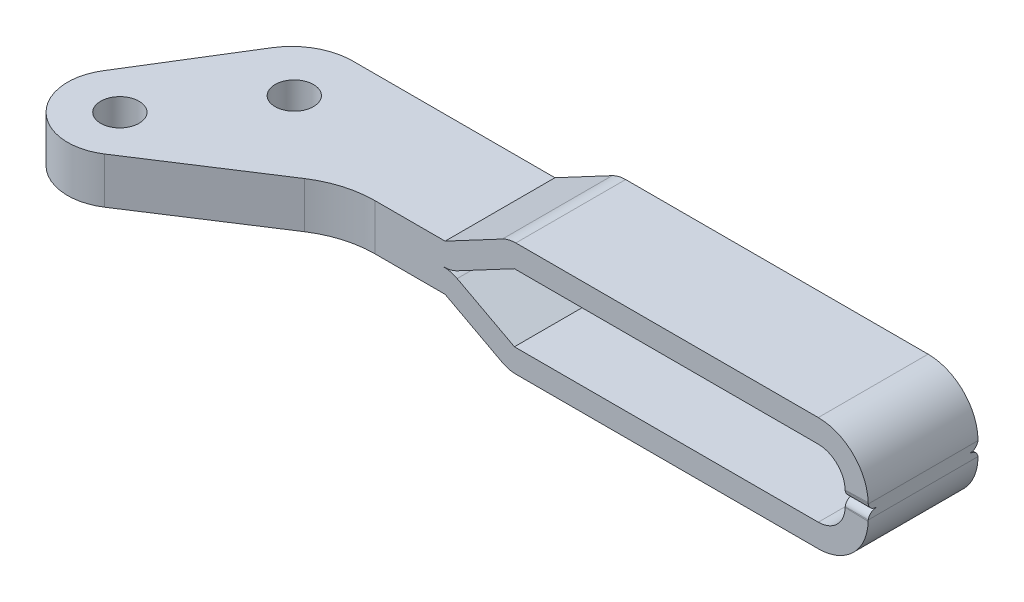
ISO-10303-21;
HEADER;
FILE_DESCRIPTION(('STEP AP214'),'2;1');
FILE_NAME('part.step','',(''),(''),'','','');
FILE_SCHEMA(('AUTOMOTIVE_DESIGN { 1 0 10303 214 1 1 1 1 }'));
ENDSEC;
DATA;
#1=APPLICATION_CONTEXT('core data for automotive mechanical design processes');
#2=APPLICATION_PROTOCOL_DEFINITION('international standard','automotive_design',2000,#1);
#3=PRODUCT_CONTEXT('',#1,'mechanical');
#4=PRODUCT('Part','Part','',(#3));
#5=PRODUCT_RELATED_PRODUCT_CATEGORY('part','',(#4));
#6=PRODUCT_DEFINITION_FORMATION('','',#4);
#7=PRODUCT_DEFINITION_CONTEXT('part definition',#1,'design');
#8=PRODUCT_DEFINITION('design','',#6,#7);
#9=PRODUCT_DEFINITION_SHAPE('','',#8);
#10=(LENGTH_UNIT() NAMED_UNIT(*) SI_UNIT(.MILLI.,.METRE.));
#11=(NAMED_UNIT(*) PLANE_ANGLE_UNIT() SI_UNIT($,.RADIAN.));
#12=(NAMED_UNIT(*) SI_UNIT($,.STERADIAN.) SOLID_ANGLE_UNIT());
#13=UNCERTAINTY_MEASURE_WITH_UNIT(LENGTH_MEASURE(1.E-05),#10,'distance_accuracy_value','');
#14=(GEOMETRIC_REPRESENTATION_CONTEXT(3) GLOBAL_UNCERTAINTY_ASSIGNED_CONTEXT((#13)) GLOBAL_UNIT_ASSIGNED_CONTEXT((#10,
#11,#12)) REPRESENTATION_CONTEXT('',''));
#15=CARTESIAN_POINT('',(0.,0.,0.));
#16=DIRECTION('',(0.,0.,1.));
#17=DIRECTION('',(1.,0.,0.));
#18=AXIS2_PLACEMENT_3D('',#15,#16,#17);
#19=CARTESIAN_POINT('',(87.7892596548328,1.027012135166,-7.64427190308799));
#20=DIRECTION('',(1.,0.,0.));
#21=DIRECTION('',(0.,1.,0.));
#22=AXIS2_PLACEMENT_3D('',#19,#20,#21);
#23=CYLINDRICAL_SURFACE('',#22,1.);
#24=CARTESIAN_POINT('',(87.789259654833,1.027012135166,-7.64427190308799));
#25=DIRECTION('',(1.,0.,0.));
#26=DIRECTION('',(0.,1.,0.));
#27=AXIS2_PLACEMENT_3D('',#24,#25,#26);
#28=CIRCLE('',#27,1.);
#29=CARTESIAN_POINT('',(87.789259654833,0.900021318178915,-6.65236801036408));
#30=VERTEX_POINT('',#29);
#31=CARTESIAN_POINT('',(87.7892596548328,0.0270121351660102,-7.64427190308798));
#32=VERTEX_POINT('',#31);
#33=EDGE_CURVE('E363',#30,#32,#28,.T.);
#34=ORIENTED_EDGE('',*,*,#33,.T.);
#35=DIRECTION('',(-1.,0.,0.));
#36=VECTOR('',#35,1.);
#37=CARTESIAN_POINT('',(87.7892596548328,0.0270121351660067,-7.64427190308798));
#38=LINE('',#37,#36);
#39=CARTESIAN_POINT('',(90.7892596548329,0.027012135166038,-7.64427190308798));
#40=VERTEX_POINT('',#39);
#41=EDGE_CURVE('E319',#32,#40,#38,.F.);
#42=ORIENTED_EDGE('',*,*,#41,.T.);
#43=CARTESIAN_POINT('',(90.7892596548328,1.027012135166,-7.64427190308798));
#44=DIRECTION('',(1.,0.,0.));
#45=DIRECTION('',(0.,1.,0.));
#46=AXIS2_PLACEMENT_3D('',#43,#44,#45);
#47=CIRCLE('',#46,1.);
#48=CARTESIAN_POINT('',(90.7892596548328,0.900021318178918,-6.65236801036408));
#49=VERTEX_POINT('',#48);
#50=EDGE_CURVE('E358',#40,#49,#47,.F.);
#51=ORIENTED_EDGE('',*,*,#50,.T.);
#52=DIRECTION('',(-1.,0.,0.));
#53=VECTOR('',#52,1.);
#54=CARTESIAN_POINT('',(89.289259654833,0.900021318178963,-6.65236801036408));
#55=LINE('',#54,#53);
#56=EDGE_CURVE('E261',#49,#30,#55,.T.);
#57=ORIENTED_EDGE('',*,*,#56,.T.);
#58=EDGE_LOOP('',(#34,#42,#51,#57));
#59=FACE_BOUND('',#58,.T.);
#60=ADVANCED_FACE('F14',(#59),#23,.T.);
#61=CARTESIAN_POINT('',(87.7892596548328,84.6911769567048,-12.9442719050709));
#62=DIRECTION('',(-1.,0.,0.));
#63=DIRECTION('',(0.,-1.,0.));
#64=AXIS2_PLACEMENT_3D('',#61,#62,#63);
#65=PLANE('',#64);
#66=CARTESIAN_POINT('',(87.7892596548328,1.02701213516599,-19.9442719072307));
#67=DIRECTION('',(1.,0.,0.));
#68=DIRECTION('',(0.,1.,0.));
#69=AXIS2_PLACEMENT_3D('',#66,#67,#68);
#70=CIRCLE('',#69,1.);
#71=CARTESIAN_POINT('',(87.7892596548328,0.0270121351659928,-19.9442719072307));
#72=VERTEX_POINT('',#71);
#73=CARTESIAN_POINT('',(87.789259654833,0.900021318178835,-20.9361757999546));
#74=VERTEX_POINT('',#73);
#75=EDGE_CURVE('E360',#72,#74,#70,.T.);
#76=ORIENTED_EDGE('',*,*,#75,.F.);
#77=DIRECTION('',(0.,-1.,0.));
#78=VECTOR('',#77,1.);
#79=CARTESIAN_POINT('',(87.7892596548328,12.6875808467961,-19.9442719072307));
#80=LINE('',#79,#78);
#81=CARTESIAN_POINT('',(87.7892596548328,-0.0270121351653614,-19.9442719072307));
#82=VERTEX_POINT('',#81);
#83=EDGE_CURVE('E906',#72,#82,#80,.T.);
#84=ORIENTED_EDGE('',*,*,#83,.T.);
#85=CARTESIAN_POINT('',(87.7892596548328,-1.02701213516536,-19.9442719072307));
#86=DIRECTION('',(-1.,0.,0.));
#87=DIRECTION('',(0.,-1.,0.));
#88=AXIS2_PLACEMENT_3D('',#85,#86,#87);
#89=CIRCLE('',#88,1.);
#90=CARTESIAN_POINT('',(87.7892596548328,-0.900021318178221,-20.9361757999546));
#91=VERTEX_POINT('',#90);
#92=EDGE_CURVE('E499',#91,#82,#89,.F.);
#93=ORIENTED_EDGE('',*,*,#92,.F.);
#94=DIRECTION('',(0.,0.,1.));
#95=VECTOR('',#94,1.);
#96=CARTESIAN_POINT('',(87.7892596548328,-0.900021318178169,-30.3826722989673));
#97=LINE('',#96,#95);
#98=CARTESIAN_POINT('',(87.7892596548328,-0.900021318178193,-6.65236801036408));
#99=VERTEX_POINT('',#98);
#100=EDGE_CURVE('E476',#91,#99,#97,.T.);
#101=ORIENTED_EDGE('',*,*,#100,.T.);
#102=CARTESIAN_POINT('',(87.7892596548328,-1.02701213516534,-7.64427190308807));
#103=DIRECTION('',(-1.,0.,0.));
#104=DIRECTION('',(0.,-1.,0.));
#105=AXIS2_PLACEMENT_3D('',#102,#103,#104);
#106=CIRCLE('',#105,1.);
#107=CARTESIAN_POINT('',(87.7892596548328,-0.0270121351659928,-7.64427190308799));
#108=VERTEX_POINT('',#107);
#109=EDGE_CURVE('E496',#108,#99,#106,.F.);
#110=ORIENTED_EDGE('',*,*,#109,.F.);
#111=DIRECTION('',(0.,-1.,0.));
#112=VECTOR('',#111,1.);
#113=CARTESIAN_POINT('',(87.7892596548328,12.6875808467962,-7.64427190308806));
#114=LINE('',#113,#112);
#115=EDGE_CURVE('E897',#32,#108,#114,.T.);
#116=ORIENTED_EDGE('',*,*,#115,.F.);
#117=ORIENTED_EDGE('',*,*,#33,.F.);
#118=DIRECTION('',(0.,0.,1.));
#119=VECTOR('',#118,1.);
#120=CARTESIAN_POINT('',(87.789259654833,0.900021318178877,-30.3826722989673));
#121=LINE('',#120,#119);
#122=EDGE_CURVE('E348',#30,#74,#121,.F.);
#123=ORIENTED_EDGE('',*,*,#122,.T.);
#124=EDGE_LOOP('',(#76,#84,#93,#101,#110,#116,#117,#123));
#125=FACE_BOUND('',#124,.T.);
#126=ADVANCED_FACE('F286',(#125),#65,.T.);
#127=CARTESIAN_POINT('',(87.7892596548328,1.02701213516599,-19.9442719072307));
#128=DIRECTION('',(1.,0.,0.));
#129=DIRECTION('',(0.,1.,0.));
#130=AXIS2_PLACEMENT_3D('',#127,#128,#129);
#131=CYLINDRICAL_SURFACE('',#130,1.);
#132=CARTESIAN_POINT('',(90.7892596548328,1.02701213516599,-19.9442719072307));
#133=DIRECTION('',(1.,0.,0.));
#134=DIRECTION('',(0.,1.,0.));
#135=AXIS2_PLACEMENT_3D('',#132,#133,#134);
#136=CIRCLE('',#135,1.);
#137=CARTESIAN_POINT('',(90.7892596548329,0.900021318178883,-20.9361757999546));
#138=VERTEX_POINT('',#137);
#139=CARTESIAN_POINT('',(90.7892596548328,0.0270121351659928,-19.9442719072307));
#140=VERTEX_POINT('',#139);
#141=EDGE_CURVE('E320',#138,#140,#136,.F.);
#142=ORIENTED_EDGE('',*,*,#141,.T.);
#143=DIRECTION('',(-1.,0.,0.));
#144=VECTOR('',#143,1.);
#145=CARTESIAN_POINT('',(87.7892596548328,0.0270121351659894,-19.9442719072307));
#146=LINE('',#145,#144);
#147=EDGE_CURVE('E316',#140,#72,#146,.T.);
#148=ORIENTED_EDGE('',*,*,#147,.T.);
#149=ORIENTED_EDGE('',*,*,#75,.T.);
#150=DIRECTION('',(1.,0.,0.));
#151=VECTOR('',#150,1.);
#152=CARTESIAN_POINT('',(89.289259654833,0.900021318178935,-20.9361757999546));
#153=LINE('',#152,#151);
#154=EDGE_CURVE('E260',#74,#138,#153,.T.);
#155=ORIENTED_EDGE('',*,*,#154,.T.);
#156=EDGE_LOOP('',(#142,#148,#149,#155));
#157=FACE_BOUND('',#156,.T.);
#158=ADVANCED_FACE('F289',(#157),#131,.T.);
#159=CARTESIAN_POINT('',(90.7892596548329,84.6911769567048,-12.9442719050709));
#160=DIRECTION('',(-1.,0.,0.));
#161=DIRECTION('',(0.,-1.,0.));
#162=AXIS2_PLACEMENT_3D('',#159,#160,#161);
#163=PLANE('',#162);
#164=DIRECTION('',(0.,0.,1.));
#165=VECTOR('',#164,1.);
#166=CARTESIAN_POINT('',(90.789259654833,0.900021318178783,-30.3826722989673));
#167=LINE('',#166,#165);
#168=EDGE_CURVE('E308',#49,#138,#167,.F.);
#169=ORIENTED_EDGE('',*,*,#168,.F.);
#170=ORIENTED_EDGE('',*,*,#50,.F.);
#171=DIRECTION('',(0.,-1.,0.));
#172=VECTOR('',#171,1.);
#173=CARTESIAN_POINT('',(90.7892596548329,12.6875808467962,-7.64427190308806));
#174=LINE('',#173,#172);
#175=CARTESIAN_POINT('',(90.7892596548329,-0.0270121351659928,-7.64427190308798));
#176=VERTEX_POINT('',#175);
#177=EDGE_CURVE('E899',#40,#176,#174,.T.);
#178=ORIENTED_EDGE('',*,*,#177,.T.);
#179=CARTESIAN_POINT('',(90.7892596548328,-1.02701213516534,-7.64427190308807));
#180=DIRECTION('',(-1.,0.,0.));
#181=DIRECTION('',(0.,-1.,0.));
#182=AXIS2_PLACEMENT_3D('',#179,#180,#181);
#183=CIRCLE('',#182,1.);
#184=CARTESIAN_POINT('',(90.7892596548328,-0.900021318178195,-6.65236801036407));
#185=VERTEX_POINT('',#184);
#186=EDGE_CURVE('E502',#185,#176,#183,.T.);
#187=ORIENTED_EDGE('',*,*,#186,.F.);
#188=DIRECTION('',(0.,0.,1.));
#189=VECTOR('',#188,1.);
#190=CARTESIAN_POINT('',(90.7892596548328,-0.900021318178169,-30.3826722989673));
#191=LINE('',#190,#189);
#192=CARTESIAN_POINT('',(90.7892596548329,-0.900021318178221,-20.9361757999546));
#193=VERTEX_POINT('',#192);
#194=EDGE_CURVE('E477',#193,#185,#191,.T.);
#195=ORIENTED_EDGE('',*,*,#194,.F.);
#196=CARTESIAN_POINT('',(90.7892596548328,-1.02701213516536,-19.9442719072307));
#197=DIRECTION('',(-1.,0.,0.));
#198=DIRECTION('',(0.,-1.,0.));
#199=AXIS2_PLACEMENT_3D('',#196,#197,#198);
#200=CIRCLE('',#199,1.);
#201=CARTESIAN_POINT('',(90.7892596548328,-0.0270121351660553,-19.9442719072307));
#202=VERTEX_POINT('',#201);
#203=EDGE_CURVE('E505',#202,#193,#200,.T.);
#204=ORIENTED_EDGE('',*,*,#203,.F.);
#205=DIRECTION('',(0.,-1.,0.));
#206=VECTOR('',#205,1.);
#207=CARTESIAN_POINT('',(90.7892596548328,12.6875808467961,-19.9442719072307));
#208=LINE('',#207,#206);
#209=EDGE_CURVE('E945',#140,#202,#208,.T.);
#210=ORIENTED_EDGE('',*,*,#209,.F.);
#211=ORIENTED_EDGE('',*,*,#141,.F.);
#212=EDGE_LOOP('',(#169,#170,#178,#187,#195,#204,#210,#211));
#213=FACE_BOUND('',#212,.T.);
#214=ADVANCED_FACE('F295',(#213),#163,.F.);
#215=CARTESIAN_POINT('',(90.7892596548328,-1.02701213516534,-7.64427190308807));
#216=DIRECTION('',(-1.,0.,0.));
#217=DIRECTION('',(0.,-1.,0.));
#218=AXIS2_PLACEMENT_3D('',#215,#216,#217);
#219=CYLINDRICAL_SURFACE('',#218,1.);
#220=DIRECTION('',(1.,0.,0.));
#221=VECTOR('',#220,1.);
#222=CARTESIAN_POINT('',(90.7892596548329,-0.027012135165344,-7.64427190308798));
#223=LINE('',#222,#221);
#224=EDGE_CURVE('E938',#176,#108,#223,.F.);
#225=ORIENTED_EDGE('',*,*,#224,.T.);
#226=ORIENTED_EDGE('',*,*,#109,.T.);
#227=DIRECTION('',(-1.,0.,0.));
#228=VECTOR('',#227,1.);
#229=CARTESIAN_POINT('',(89.2892596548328,-0.900021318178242,-6.65236801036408));
#230=LINE('',#229,#228);
#231=EDGE_CURVE('E438',#185,#99,#230,.T.);
#232=ORIENTED_EDGE('',*,*,#231,.F.);
#233=ORIENTED_EDGE('',*,*,#186,.T.);
#234=EDGE_LOOP('',(#225,#226,#232,#233));
#235=FACE_BOUND('',#234,.T.);
#236=ADVANCED_FACE('F467',(#235),#219,.T.);
#237=CARTESIAN_POINT('',(90.7892596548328,-1.02701213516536,-19.9442719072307));
#238=DIRECTION('',(-1.,0.,0.));
#239=DIRECTION('',(0.,-1.,0.));
#240=AXIS2_PLACEMENT_3D('',#237,#238,#239);
#241=CYLINDRICAL_SURFACE('',#240,1.);
#242=DIRECTION('',(1.,0.,0.));
#243=VECTOR('',#242,1.);
#244=CARTESIAN_POINT('',(90.7892596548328,-0.0270121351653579,-19.9442719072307));
#245=LINE('',#244,#243);
#246=EDGE_CURVE('E498',#82,#202,#245,.T.);
#247=ORIENTED_EDGE('',*,*,#246,.T.);
#248=ORIENTED_EDGE('',*,*,#203,.T.);
#249=DIRECTION('',(1.,0.,0.));
#250=VECTOR('',#249,1.);
#251=CARTESIAN_POINT('',(89.2892596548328,-0.900021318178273,-20.9361757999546));
#252=LINE('',#251,#250);
#253=EDGE_CURVE('E863',#91,#193,#252,.T.);
#254=ORIENTED_EDGE('',*,*,#253,.F.);
#255=ORIENTED_EDGE('',*,*,#92,.T.);
#256=EDGE_LOOP('',(#247,#248,#254,#255));
#257=FACE_BOUND('',#256,.T.);
#258=ADVANCED_FACE('F658',(#257),#241,.T.);
#259=CARTESIAN_POINT('',(90.789259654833,0.900021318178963,-6.65236801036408));
#260=CARTESIAN_POINT('',(90.789259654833,0.954749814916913,-6.6476538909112));
#261=CARTESIAN_POINT('',(90.788568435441,1.00977926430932,-6.64495518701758));
#262=CARTESIAN_POINT('',(90.7871633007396,1.06509163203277,-6.64427190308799));
#263=CARTESIAN_POINT('',(87.789259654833,0.900021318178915,-6.65236801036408));
#264=CARTESIAN_POINT('',(87.789259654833,0.929490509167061,-6.64765389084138));
#265=CARTESIAN_POINT('',(87.7888874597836,0.959121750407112,-6.64495518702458));
#266=CARTESIAN_POINT('',(87.7881308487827,0.988905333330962,-6.64427190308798));
#267=B_SPLINE_SURFACE_WITH_KNOTS('',1,3,((#259,#260,#261,#262),(#263,#264,#265,#266)),
.UNSPECIFIED.,.F.,.F.,.F.,(2,2),(4,4),(0.,1.),(0.,1.),.UNSPECIFIED.);
#268=CARTESIAN_POINT('',(90.7871633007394,1.06509163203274,-6.64427190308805));
#269=CARTESIAN_POINT('',(90.7873388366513,1.05818180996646,-6.64435730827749));
#270=CARTESIAN_POINT('',(90.7875033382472,1.05127209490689,-6.64447421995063));
#271=CARTESIAN_POINT('',(90.7878100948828,1.03746157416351,-6.64477108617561));
#272=CARTESIAN_POINT('',(90.7879523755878,1.03056076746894,-6.64495096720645));
#273=CARTESIAN_POINT('',(90.7882147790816,1.01676813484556,-6.64537377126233));
#274=CARTESIAN_POINT('',(90.788334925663,1.00987630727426,-6.64561662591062));
#275=CARTESIAN_POINT('',(90.7885531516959,0.996101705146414,-6.64616537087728));
#276=CARTESIAN_POINT('',(90.7886512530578,0.989218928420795,-6.6464711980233));
#277=CARTESIAN_POINT('',(90.7888254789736,0.975462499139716,-6.64714588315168));
#278=CARTESIAN_POINT('',(90.7889016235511,0.968588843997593,-6.64751468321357));
#279=CARTESIAN_POINT('',(90.7890320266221,0.954850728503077,-6.64831530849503));
#280=CARTESIAN_POINT('',(90.7890863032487,0.947986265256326,-6.64874708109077));
#281=CARTESIAN_POINT('',(90.7891730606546,0.93426660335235,-6.64967364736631));
#282=CARTESIAN_POINT('',(90.7892055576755,0.927411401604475,-6.65016839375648));
#283=CARTESIAN_POINT('',(90.7892488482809,0.913710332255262,-6.65122089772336));
#284=CARTESIAN_POINT('',(90.7892596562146,0.90686446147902,-6.6517786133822));
#285=CARTESIAN_POINT('',(90.789259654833,0.900021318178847,-6.6523680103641));
#286=B_SPLINE_CURVE_WITH_KNOTS('',3,(#268,#269,#270,#271,#272,#273,#274,#275,#276,#277,#278,
#279,#280,#281,#282,#283,#284,#285),.UNSPECIFIED.,.F.,.F.,(4,2,2,2,2,2,2,2,4),(0.,
0.0207376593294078,0.0414511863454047,0.0621423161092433,0.0828127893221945,0.103464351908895,
0.124098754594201,0.144717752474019,0.16532310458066),.UNSPECIFIED.);
#287=CARTESIAN_POINT('',(90.7871633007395,1.06509163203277,-6.64427190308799));
#288=VERTEX_POINT('',#287);
#289=EDGE_CURVE('E299',#288,#49,#286,.T.);
#290=DIRECTION('',(-0.999677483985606,-0.0253954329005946,0.));
#291=VECTOR('',#290,1.);
#292=CARTESIAN_POINT('',(90.7871633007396,1.06509163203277,-6.64427190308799));
#293=LINE('',#292,#291);
#294=CARTESIAN_POINT('',(87.7881308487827,0.988905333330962,-6.64427190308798));
#295=VERTEX_POINT('',#294);
#296=EDGE_CURVE('E307',#288,#295,#293,.T.);
#297=CARTESIAN_POINT('',(87.7881308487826,0.988905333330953,-6.64427190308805));
#298=CARTESIAN_POINT('',(87.7882253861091,0.985184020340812,-6.64435731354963));
#299=CARTESIAN_POINT('',(87.7883139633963,0.981463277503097,-6.64447424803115));
#300=CARTESIAN_POINT('',(87.7884791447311,0.974026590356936,-6.64477112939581));
#301=CARTESIAN_POINT('',(87.7885557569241,0.970310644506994,-6.64495103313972));
#302=CARTESIAN_POINT('',(87.7886970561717,0.962883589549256,-6.64537385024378));
#303=CARTESIAN_POINT('',(87.7887617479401,0.95917247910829,-6.64561673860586));
#304=CARTESIAN_POINT('',(87.7888792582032,0.95175513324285,-6.64616550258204));
#305=CARTESIAN_POINT('',(87.7889320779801,0.948048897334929,-6.64647137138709));
#306=CARTESIAN_POINT('',(87.7890258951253,0.940641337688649,-6.64714607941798));
#307=CARTESIAN_POINT('',(87.7890668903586,0.936940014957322,-6.64751492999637));
#308=CARTESIAN_POINT('',(87.789137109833,0.929542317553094,-6.64831558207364));
#309=CARTESIAN_POINT('',(87.7891663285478,0.925845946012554,-6.64874741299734));
#310=CARTESIAN_POINT('',(87.7892130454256,0.91845818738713,-6.64967401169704));
#311=CARTESIAN_POINT('',(87.7892305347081,0.914766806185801,-6.65016882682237));
#312=CARTESIAN_POINT('',(87.7892538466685,0.907389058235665,-6.65122136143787));
#313=CARTESIAN_POINT('',(87.789259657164,0.903702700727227,-6.65177914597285));
#314=CARTESIAN_POINT('',(87.789259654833,0.900021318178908,-6.6523680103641));
#315=B_SPLINE_CURVE_WITH_KNOTS('',3,(#297,#298,#299,#300,#301,#302,#303,#304,#305,#306,#307,
#308,#309,#310,#311,#312,#313,#314),.UNSPECIFIED.,.F.,.F.,(4,2,2,2,2,2,2,2,4),(0.,
0.0111703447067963,0.0223330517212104,0.0334913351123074,0.0446484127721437,0.055807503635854,
0.0669718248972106,0.0781445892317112,0.0893290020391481),.UNSPECIFIED.);
#316=EDGE_CURVE('E262',#30,#295,#315,.F.);
#317=ORIENTED_EDGE('',*,*,#289,.F.);
#318=ORIENTED_EDGE('',*,*,#296,.T.);
#319=ORIENTED_EDGE('',*,*,#316,.F.);
#320=ORIENTED_EDGE('',*,*,#56,.F.);
#321=EDGE_LOOP('',(#317,#318,#319,#320));
#322=FACE_BOUND('',#321,.T.);
#323=ADVANCED_FACE('F713',(#322),#267,.F.);
#324=CARTESIAN_POINT('',(35.5222243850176,3.73660000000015,0.857849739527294));
#325=DIRECTION('',(0.,0.,-1.));
#326=DIRECTION('',(0.,1.,0.));
#327=AXIS2_PLACEMENT_3D('',#324,#325,#326);
#328=CYLINDRICAL_SURFACE('',#327,3.7366);
#329=DIRECTION('',(0.,0.,-1.));
#330=VECTOR('',#329,1.);
#331=CARTESIAN_POINT('',(37.2764518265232,0.437378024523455,0.857849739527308));
#332=LINE('',#331,#330);
#333=CARTESIAN_POINT('',(37.2764518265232,0.43737802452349,-20.9442719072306));
#334=VERTEX_POINT('',#333);
#335=CARTESIAN_POINT('',(37.2764518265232,0.437378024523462,-6.64427190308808));
#336=VERTEX_POINT('',#335);
#337=EDGE_CURVE('E207',#334,#336,#332,.F.);
#338=ORIENTED_EDGE('',*,*,#337,.T.);
#339=CARTESIAN_POINT('',(35.5222243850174,3.73660000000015,-6.6442719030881));
#340=DIRECTION('',(0.,0.,-1.));
#341=DIRECTION('',(0.,1.,0.));
#342=AXIS2_PLACEMENT_3D('',#339,#340,#341);
#343=CIRCLE('',#342,3.7366);
#344=CARTESIAN_POINT('',(35.5222243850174,1.04083408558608E-13,-6.64427190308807));
#345=VERTEX_POINT('',#344);
#346=EDGE_CURVE('E215',#336,#345,#343,.T.);
#347=ORIENTED_EDGE('',*,*,#346,.T.);
#348=DIRECTION('',(0.,0.,1.));
#349=VECTOR('',#348,1.);
#350=CARTESIAN_POINT('',(35.5222243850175,0.,-12.9442719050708));
#351=LINE('',#350,#349);
#352=CARTESIAN_POINT('',(35.5222243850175,0.,-20.9442719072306));
#353=VERTEX_POINT('',#352);
#354=EDGE_CURVE('E9',#353,#345,#351,.T.);
#355=ORIENTED_EDGE('',*,*,#354,.F.);
#356=CARTESIAN_POINT('',(35.5222243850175,3.73660000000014,-20.9442719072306));
#357=DIRECTION('',(0.,0.,-1.));
#358=DIRECTION('',(0.,1.,0.));
#359=AXIS2_PLACEMENT_3D('',#356,#357,#358);
#360=CIRCLE('',#359,3.7366);
#361=EDGE_CURVE('E224',#353,#334,#360,.F.);
#362=ORIENTED_EDGE('',*,*,#361,.T.);
#363=EDGE_LOOP('',(#338,#347,#355,#362));
#364=FACE_BOUND('',#363,.T.);
#365=ADVANCED_FACE('F222',(#364),#328,.T.);
#366=CARTESIAN_POINT('',(13.2508568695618,-12.3372574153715,-12.9442719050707));
#367=DIRECTION('',(0.469471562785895,-0.882947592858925,0.));
#368=DIRECTION('',(0.882947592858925,0.469471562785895,0.));
#369=AXIS2_PLACEMENT_3D('',#366,#367,#368);
#370=PLANE('',#369);
#371=DIRECTION('',(0.882947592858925,0.469471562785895,0.));
#372=VECTOR('',#371,1.);
#373=CARTESIAN_POINT('',(13.2508568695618,-12.3372574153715,-6.64427190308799));
#374=LINE('',#373,#372);
#375=CARTESIAN_POINT('',(44.7290999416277,4.40002131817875,-6.64427190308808));
#376=VERTEX_POINT('',#375);
#377=EDGE_CURVE('E202',#376,#336,#374,.F.);
#378=ORIENTED_EDGE('',*,*,#377,.T.);
#379=ORIENTED_EDGE('',*,*,#337,.F.);
#380=DIRECTION('',(0.882947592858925,0.469471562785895,0.));
#381=VECTOR('',#380,1.);
#382=CARTESIAN_POINT('',(13.2508568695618,-12.3372574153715,-20.9442719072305));
#383=LINE('',#382,#381);
#384=CARTESIAN_POINT('',(44.7290999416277,4.40002131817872,-20.9442719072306));
#385=VERTEX_POINT('',#384);
#386=EDGE_CURVE('E212',#334,#385,#383,.T.);
#387=ORIENTED_EDGE('',*,*,#386,.T.);
#388=DIRECTION('',(0.,0.,-1.));
#389=VECTOR('',#388,1.);
#390=CARTESIAN_POINT('',(44.7290999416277,4.40002131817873,-12.9442719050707));
#391=LINE('',#390,#389);
#392=EDGE_CURVE('E209',#376,#385,#391,.T.);
#393=ORIENTED_EDGE('',*,*,#392,.F.);
#394=EDGE_LOOP('',(#378,#379,#387,#393));
#395=FACE_BOUND('',#394,.T.);
#396=ADVANCED_FACE('F204',(#395),#370,.T.);
#397=CARTESIAN_POINT('',(8.35208565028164,4.40002131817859,-12.9442719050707));
#398=DIRECTION('',(0.,-1.,0.));
#399=DIRECTION('',(1.,0.,0.));
#400=AXIS2_PLACEMENT_3D('',#397,#398,#399);
#401=PLANE('',#400);
#402=DIRECTION('',(1.,0.,0.));
#403=VECTOR('',#402,1.);
#404=CARTESIAN_POINT('',(8.35208565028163,4.40002131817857,-6.64427190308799));
#405=LINE('',#404,#403);
#406=CARTESIAN_POINT('',(84.289259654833,4.40002131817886,-6.644271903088));
#407=VERTEX_POINT('',#406);
#408=EDGE_CURVE('E238',#407,#376,#405,.F.);
#409=ORIENTED_EDGE('',*,*,#408,.T.);
#410=ORIENTED_EDGE('',*,*,#392,.T.);
#411=DIRECTION('',(1.,0.,0.));
#412=VECTOR('',#411,1.);
#413=CARTESIAN_POINT('',(8.35208565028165,4.40002131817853,-20.9442719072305));
#414=LINE('',#413,#412);
#415=CARTESIAN_POINT('',(84.289259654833,4.40002131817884,-20.9442719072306));
#416=VERTEX_POINT('',#415);
#417=EDGE_CURVE('E242',#385,#416,#414,.T.);
#418=ORIENTED_EDGE('',*,*,#417,.T.);
#419=DIRECTION('',(0.,0.,1.));
#420=VECTOR('',#419,1.);
#421=CARTESIAN_POINT('',(84.289259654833,4.40002131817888,-12.9442719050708));
#422=LINE('',#421,#420);
#423=EDGE_CURVE('E241',#416,#407,#422,.T.);
#424=ORIENTED_EDGE('',*,*,#423,.T.);
#425=EDGE_LOOP('',(#409,#410,#418,#424));
#426=FACE_BOUND('',#425,.T.);
#427=ADVANCED_FACE('F276',(#426),#401,.T.);
#428=CARTESIAN_POINT('',(84.289259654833,0.900021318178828,-30.3826722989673));
#429=DIRECTION('',(0.,0.,1.));
#430=DIRECTION('',(0.,-1.,0.));
#431=AXIS2_PLACEMENT_3D('',#428,#429,#430);
#432=CYLINDRICAL_SURFACE('',#431,3.5);
#433=CARTESIAN_POINT('',(84.289259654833,0.900021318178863,-6.64427190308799));
#434=DIRECTION('',(0.,0.,1.));
#435=DIRECTION('',(0.,-1.,0.));
#436=AXIS2_PLACEMENT_3D('',#433,#434,#435);
#437=CIRCLE('',#436,3.5);
#438=EDGE_CURVE('E253',#407,#295,#437,.F.);
#439=ORIENTED_EDGE('',*,*,#438,.F.);
#440=ORIENTED_EDGE('',*,*,#423,.F.);
#441=CARTESIAN_POINT('',(84.289259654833,0.900021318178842,-20.9442719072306));
#442=DIRECTION('',(0.,0.,1.));
#443=DIRECTION('',(0.,-1.,0.));
#444=AXIS2_PLACEMENT_3D('',#441,#442,#443);
#445=CIRCLE('',#444,3.5);
#446=CARTESIAN_POINT('',(87.7881308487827,0.988905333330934,-20.9442719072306));
#447=VERTEX_POINT('',#446);
#448=EDGE_CURVE('E346',#447,#416,#445,.T.);
#449=ORIENTED_EDGE('',*,*,#448,.F.);
#450=CARTESIAN_POINT('',(87.789259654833,0.900021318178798,-20.9361757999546));
#451=CARTESIAN_POINT('',(87.789259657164,0.903702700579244,-20.9367646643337));
#452=CARTESIAN_POINT('',(87.789253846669,0.907389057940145,-20.9373224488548));
#453=CARTESIAN_POINT('',(87.7892305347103,0.914766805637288,-20.9383749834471));
#454=CARTESIAN_POINT('',(87.7892130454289,0.918458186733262,-20.9388697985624));
#455=CARTESIAN_POINT('',(87.7891663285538,0.925845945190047,-20.9397963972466));
#456=CARTESIAN_POINT('',(87.7891371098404,0.929542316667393,-20.9402282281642));
#457=CARTESIAN_POINT('',(87.7890668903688,0.936940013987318,-20.9410288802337));
#458=CARTESIAN_POINT('',(87.7890258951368,0.940641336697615,-20.9413977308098));
#459=CARTESIAN_POINT('',(87.7889320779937,0.94804889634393,-20.9420724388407));
#460=CARTESIAN_POINT('',(87.7888792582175,0.951755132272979,-20.9423783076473));
#461=CARTESIAN_POINT('',(87.7887617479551,0.959172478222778,-20.9429270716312));
#462=CARTESIAN_POINT('',(87.7886970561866,0.962883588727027,-20.9431699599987));
#463=CARTESIAN_POINT('',(87.7885557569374,0.970310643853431,-20.9435927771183));
#464=CARTESIAN_POINT('',(87.7884791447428,0.974026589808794,-20.9437726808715));
#465=CARTESIAN_POINT('',(87.7883139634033,0.981463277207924,-20.9440695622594));
#466=CARTESIAN_POINT('',(87.7882253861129,0.985184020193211,-20.9441864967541));
#467=CARTESIAN_POINT('',(87.7881308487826,0.988905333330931,-20.9442719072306));
#468=B_SPLINE_CURVE_WITH_KNOTS('',3,(#450,#451,#452,#453,#454,#455,#456,#457,#458,#459,#460,
#461,#462,#463,#464,#465,#466,#467),.UNSPECIFIED.,.F.,.F.,(4,2,2,2,2,2,2,2,4),(0.,
0.0111844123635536,0.0223571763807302,0.0335214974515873,0.0446805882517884,0.0558376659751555,
0.0669959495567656,0.0781586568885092,0.0893290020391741),.UNSPECIFIED.);
#469=EDGE_CURVE('E256',#447,#74,#468,.F.);
#470=ORIENTED_EDGE('',*,*,#469,.T.);
#471=ORIENTED_EDGE('',*,*,#122,.F.);
#472=ORIENTED_EDGE('',*,*,#316,.T.);
#473=EDGE_LOOP('',(#439,#440,#449,#470,#471,#472));
#474=FACE_BOUND('',#473,.T.);
#475=ADVANCED_FACE('F265',(#474),#432,.F.);
#476=CARTESIAN_POINT('',(90.7871633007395,1.06509163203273,-20.9442719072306));
#477=CARTESIAN_POINT('',(90.7885684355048,1.00977926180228,-20.9435886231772));
#478=CARTESIAN_POINT('',(90.789259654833,0.954749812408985,-20.9408899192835));
#479=CARTESIAN_POINT('',(90.7892596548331,0.900021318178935,-20.9361757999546));
#480=CARTESIAN_POINT('',(87.7881308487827,0.988905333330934,-20.9442719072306));
#481=CARTESIAN_POINT('',(87.7888874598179,0.959121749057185,-20.9435886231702));
#482=CARTESIAN_POINT('',(87.789259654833,0.929490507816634,-20.9408899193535));
#483=CARTESIAN_POINT('',(87.789259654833,0.900021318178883,-20.9361757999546));
#484=B_SPLINE_SURFACE_WITH_KNOTS('',1,3,((#476,#477,#478,#479),(#480,#481,#482,#483)),
.UNSPECIFIED.,.F.,.F.,.F.,(2,2),(4,4),(0.,1.),(0.,1.),.UNSPECIFIED.);
#485=CARTESIAN_POINT('',(90.789259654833,0.900021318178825,-20.9361757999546));
#486=CARTESIAN_POINT('',(90.7892596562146,0.906864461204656,-20.9367651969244));
#487=CARTESIAN_POINT('',(90.7892488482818,0.91371033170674,-20.9373229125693));
#488=CARTESIAN_POINT('',(90.7892055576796,0.927411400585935,-20.938375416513));
#489=CARTESIAN_POINT('',(90.7891730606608,0.934266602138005,-20.9388701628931));
#490=CARTESIAN_POINT('',(90.7890863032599,0.947986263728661,-20.9397967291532));
#491=CARTESIAN_POINT('',(90.7890320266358,0.954850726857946,-20.9402285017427));
#492=CARTESIAN_POINT('',(90.7889016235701,0.96858884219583,-20.9410291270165));
#493=CARTESIAN_POINT('',(90.788825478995,0.975462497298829,-20.9413979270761));
#494=CARTESIAN_POINT('',(90.7886512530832,0.989218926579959,-20.9420726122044));
#495=CARTESIAN_POINT('',(90.7885531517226,0.996101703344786,-20.942378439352));
#496=CARTESIAN_POINT('',(90.7883349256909,1.00987630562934,-20.9429271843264));
#497=CARTESIAN_POINT('',(90.7882147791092,1.01676813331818,-20.9431700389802));
#498=CARTESIAN_POINT('',(90.7879523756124,1.0305607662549,-20.9435928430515));
#499=CARTESIAN_POINT('',(90.7878100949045,1.0374615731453,-20.9437727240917));
#500=CARTESIAN_POINT('',(90.7875033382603,1.05127209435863,-20.9440695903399));
#501=CARTESIAN_POINT('',(90.7873388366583,1.05818180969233,-20.9441865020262));
#502=CARTESIAN_POINT('',(90.7871633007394,1.06509163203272,-20.9442719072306));
#503=B_SPLINE_CURVE_WITH_KNOTS('',3,(#485,#486,#487,#488,#489,#490,#491,#492,#493,#494,#495,
#496,#497,#498,#499,#500,#501,#502),.UNSPECIFIED.,.F.,.F.,(4,2,2,2,2,2,2,2,4),(0.,
0.0206053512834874,0.0412243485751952,0.0618587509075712,0.0825103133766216,0.103180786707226,
0.123871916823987,0.144585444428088,0.165323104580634),.UNSPECIFIED.);
#504=CARTESIAN_POINT('',(90.7871633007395,1.06509163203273,-20.9442719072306));
#505=VERTEX_POINT('',#504);
#506=EDGE_CURVE('E303',#138,#505,#503,.T.);
#507=DIRECTION('',(0.999677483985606,0.0253954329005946,0.));
#508=VECTOR('',#507,1.);
#509=CARTESIAN_POINT('',(87.7881308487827,0.988905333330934,-20.9442719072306));
#510=LINE('',#509,#508);
#511=EDGE_CURVE('E352',#447,#505,#510,.T.);
#512=ORIENTED_EDGE('',*,*,#506,.F.);
#513=ORIENTED_EDGE('',*,*,#154,.F.);
#514=ORIENTED_EDGE('',*,*,#469,.F.);
#515=ORIENTED_EDGE('',*,*,#511,.T.);
#516=EDGE_LOOP('',(#512,#513,#514,#515));
#517=FACE_BOUND('',#516,.T.);
#518=ADVANCED_FACE('F275',(#517),#484,.F.);
#519=CARTESIAN_POINT('',(84.289259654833,0.900021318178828,-30.3826722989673));
#520=DIRECTION('',(0.,0.,1.));
#521=DIRECTION('',(0.,-1.,0.));
#522=AXIS2_PLACEMENT_3D('',#519,#520,#521);
#523=CYLINDRICAL_SURFACE('',#522,6.5);
#524=DIRECTION('',(0.,0.,1.));
#525=VECTOR('',#524,1.);
#526=CARTESIAN_POINT('',(84.289259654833,7.40002131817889,-12.9442719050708));
#527=LINE('',#526,#525);
#528=CARTESIAN_POINT('',(84.289259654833,7.40002131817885,-20.9442719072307));
#529=VERTEX_POINT('',#528);
#530=CARTESIAN_POINT('',(84.289259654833,7.40002131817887,-6.64427190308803));
#531=VERTEX_POINT('',#530);
#532=EDGE_CURVE('E351',#529,#531,#527,.T.);
#533=ORIENTED_EDGE('',*,*,#532,.T.);
#534=CARTESIAN_POINT('',(84.289259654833,0.900021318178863,-6.64427190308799));
#535=DIRECTION('',(0.,0.,1.));
#536=DIRECTION('',(0.,-1.,0.));
#537=AXIS2_PLACEMENT_3D('',#534,#535,#536);
#538=CIRCLE('',#537,6.5);
#539=EDGE_CURVE('E353',#531,#288,#538,.F.);
#540=ORIENTED_EDGE('',*,*,#539,.T.);
#541=ORIENTED_EDGE('',*,*,#289,.T.);
#542=ORIENTED_EDGE('',*,*,#168,.T.);
#543=ORIENTED_EDGE('',*,*,#506,.T.);
#544=CARTESIAN_POINT('',(84.289259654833,0.900021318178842,-20.9442719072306));
#545=DIRECTION('',(0.,0.,1.));
#546=DIRECTION('',(0.,-1.,0.));
#547=AXIS2_PLACEMENT_3D('',#544,#545,#546);
#548=CIRCLE('',#547,6.5);
#549=EDGE_CURVE('E349',#505,#529,#548,.T.);
#550=ORIENTED_EDGE('',*,*,#549,.T.);
#551=EDGE_LOOP('',(#533,#540,#541,#542,#543,#550));
#552=FACE_BOUND('',#551,.T.);
#553=ADVANCED_FACE('F284',(#552),#523,.T.);
#554=CARTESIAN_POINT('',(8.35208565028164,7.40002131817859,-12.9442719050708));
#555=DIRECTION('',(0.,-1.,0.));
#556=DIRECTION('',(1.,0.,0.));
#557=AXIS2_PLACEMENT_3D('',#554,#555,#556);
#558=PLANE('',#557);
#559=DIRECTION('',(1.,0.,0.));
#560=VECTOR('',#559,1.);
#561=CARTESIAN_POINT('',(92.0162504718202,7.40002131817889,-20.9442719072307));
#562=LINE('',#561,#560);
#563=CARTESIAN_POINT('',(44.9127549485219,7.40002131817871,-20.9442719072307));
#564=VERTEX_POINT('',#563);
#565=EDGE_CURVE('E248',#529,#564,#562,.F.);
#566=ORIENTED_EDGE('',*,*,#565,.T.);
#567=DIRECTION('',(0.,0.,-1.));
#568=VECTOR('',#567,1.);
#569=CARTESIAN_POINT('',(44.912754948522,7.40002131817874,0.857849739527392));
#570=LINE('',#569,#568);
#571=CARTESIAN_POINT('',(44.9127549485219,7.40002131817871,-6.64427190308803));
#572=VERTEX_POINT('',#571);
#573=EDGE_CURVE('E245',#572,#564,#570,.T.);
#574=ORIENTED_EDGE('',*,*,#573,.F.);
#575=DIRECTION('',(1.,0.,0.));
#576=VECTOR('',#575,1.);
#577=CARTESIAN_POINT('',(25.5149120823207,7.40002131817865,-6.64427190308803));
#578=LINE('',#577,#576);
#579=EDGE_CURVE('E250',#572,#531,#578,.T.);
#580=ORIENTED_EDGE('',*,*,#579,.T.);
#581=ORIENTED_EDGE('',*,*,#532,.F.);
#582=EDGE_LOOP('',(#566,#574,#580,#581));
#583=FACE_BOUND('',#582,.T.);
#584=ADVANCED_FACE('F278',(#583),#558,.F.);
#585=CARTESIAN_POINT('',(44.912754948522,3.66342131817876,0.857849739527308));
#586=DIRECTION('',(0.,0.,-1.));
#587=DIRECTION('',(0.,1.,0.));
#588=AXIS2_PLACEMENT_3D('',#585,#586,#587);
#589=CYLINDRICAL_SURFACE('',#588,3.7366);
#590=DIRECTION('',(0.,0.,1.));
#591=VECTOR('',#590,1.);
#592=CARTESIAN_POINT('',(43.1585275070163,6.96264329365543,-12.9442719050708));
#593=LINE('',#592,#591);
#594=CARTESIAN_POINT('',(43.1585275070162,6.96264329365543,-20.9442719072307));
#595=VERTEX_POINT('',#594);
#596=CARTESIAN_POINT('',(43.1585275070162,6.96264329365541,-6.64427190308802));
#597=VERTEX_POINT('',#596);
#598=EDGE_CURVE('E235',#595,#597,#593,.T.);
#599=ORIENTED_EDGE('',*,*,#598,.T.);
#600=CARTESIAN_POINT('',(44.9127549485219,3.66342131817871,-6.64427190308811));
#601=DIRECTION('',(0.,0.,-1.));
#602=DIRECTION('',(0.,1.,0.));
#603=AXIS2_PLACEMENT_3D('',#600,#601,#602);
#604=CIRCLE('',#603,3.7366);
#605=EDGE_CURVE('E240',#597,#572,#604,.T.);
#606=ORIENTED_EDGE('',*,*,#605,.T.);
#607=ORIENTED_EDGE('',*,*,#573,.T.);
#608=CARTESIAN_POINT('',(44.9127549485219,3.66342131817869,-20.9442719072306));
#609=DIRECTION('',(0.,0.,-1.));
#610=DIRECTION('',(0.,1.,0.));
#611=AXIS2_PLACEMENT_3D('',#608,#609,#610);
#612=CIRCLE('',#611,3.7366);
#613=EDGE_CURVE('E237',#564,#595,#612,.F.);
#614=ORIENTED_EDGE('',*,*,#613,.T.);
#615=EDGE_LOOP('',(#599,#606,#607,#614));
#616=FACE_BOUND('',#615,.T.);
#617=ADVANCED_FACE('F279',(#616),#589,.T.);
#618=CARTESIAN_POINT('',(11.8424421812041,-9.68841463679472,-12.9442719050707));
#619=DIRECTION('',(0.469471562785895,-0.882947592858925,0.));
#620=DIRECTION('',(0.882947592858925,0.469471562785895,0.));
#621=AXIS2_PLACEMENT_3D('',#618,#619,#620);
#622=PLANE('',#621);
#623=DIRECTION('',(-0.882947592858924,-0.469471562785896,0.));
#624=VECTOR('',#623,1.);
#625=CARTESIAN_POINT('',(43.1585275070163,6.96264329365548,-20.9442719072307));
#626=LINE('',#625,#624);
#627=CARTESIAN_POINT('',(35.7058793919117,3.00000000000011,-20.9442719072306));
#628=VERTEX_POINT('',#627);
#629=EDGE_CURVE('E231',#595,#628,#626,.T.);
#630=ORIENTED_EDGE('',*,*,#629,.T.);
#631=DIRECTION('',(0.,0.,1.));
#632=VECTOR('',#631,1.);
#633=CARTESIAN_POINT('',(35.7058793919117,3.00000000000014,0.));
#634=LINE('',#633,#632);
#635=CARTESIAN_POINT('',(35.7058793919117,3.00000000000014,-6.64427190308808));
#636=VERTEX_POINT('',#635);
#637=EDGE_CURVE('E20',#628,#636,#634,.T.);
#638=ORIENTED_EDGE('',*,*,#637,.T.);
#639=DIRECTION('',(0.882947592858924,0.469471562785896,0.));
#640=VECTOR('',#639,1.);
#641=CARTESIAN_POINT('',(35.8680371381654,3.08622080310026,-6.6442719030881));
#642=LINE('',#641,#640);
#643=EDGE_CURVE('E195',#636,#597,#642,.T.);
#644=ORIENTED_EDGE('',*,*,#643,.T.);
#645=ORIENTED_EDGE('',*,*,#598,.F.);
#646=EDGE_LOOP('',(#630,#638,#644,#645));
#647=FACE_BOUND('',#646,.T.);
#648=ADVANCED_FACE('F543',(#647),#622,.F.);
#649=CARTESIAN_POINT('',(90.7892596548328,-0.900021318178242,-6.65236801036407));
#650=CARTESIAN_POINT('',(90.7892596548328,-0.955050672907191,-6.64966930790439));
#651=CARTESIAN_POINT('',(90.7885607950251,-1.01008002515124,-6.64697060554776));
#652=CARTESIAN_POINT('',(90.7871633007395,-1.06509163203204,-6.64427190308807));
#653=CARTESIAN_POINT('',(87.7892596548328,-0.900021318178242,-6.65236801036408));
#654=CARTESIAN_POINT('',(87.7892596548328,-0.929652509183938,-6.64966930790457));
#655=CARTESIAN_POINT('',(87.7888833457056,-0.959283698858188,-6.64697060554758));
#656=CARTESIAN_POINT('',(87.7881308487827,-0.988905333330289,-6.64427190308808));
#657=B_SPLINE_SURFACE_WITH_KNOTS('',1,3,((#649,#650,#651,#652),(#653,#654,#655,#656)),
.UNSPECIFIED.,.F.,.F.,.F.,(2,2),(4,4),(0.,1.),(0.,1.),.UNSPECIFIED.);
#658=DIRECTION('',(-0.999677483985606,0.0253954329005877,0.));
#659=VECTOR('',#658,1.);
#660=CARTESIAN_POINT('',(90.7871633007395,-1.06509163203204,-6.64427190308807));
#661=LINE('',#660,#659);
#662=CARTESIAN_POINT('',(90.7871633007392,-1.06509163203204,-6.64427190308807));
#663=VERTEX_POINT('',#662);
#664=CARTESIAN_POINT('',(87.7881308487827,-0.988905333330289,-6.64427190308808));
#665=VERTEX_POINT('',#664);
#666=EDGE_CURVE('E421',#663,#665,#661,.T.);
#667=CARTESIAN_POINT('',(90.7892596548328,-0.900021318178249,-6.6523680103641));
#668=CARTESIAN_POINT('',(90.7892596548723,-0.906899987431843,-6.65203067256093));
#669=CARTESIAN_POINT('',(90.7892487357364,-0.91377865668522,-6.65169333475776));
#670=CARTESIAN_POINT('',(90.7892050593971,-0.927535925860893,-6.65101865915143));
#671=CARTESIAN_POINT('',(90.7891723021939,-0.934414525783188,-6.65068132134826));
#672=CARTESIAN_POINT('',(90.7890849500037,-0.948171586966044,-6.65000664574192));
#673=CARTESIAN_POINT('',(90.7890303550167,-0.955050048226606,-6.64966930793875));
#674=CARTESIAN_POINT('',(90.788899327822,-0.968806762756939,-6.64899463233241));
#675=CARTESIAN_POINT('',(90.7888228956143,-0.975685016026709,-6.64865729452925));
#676=CARTESIAN_POINT('',(90.7886481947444,-0.989441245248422,-6.64798261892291));
#677=CARTESIAN_POINT('',(90.7885499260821,-0.996319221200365,-6.64764528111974));
#678=CARTESIAN_POINT('',(90.7883315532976,-1.01007482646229,-6.6469706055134));
#679=CARTESIAN_POINT('',(90.7882114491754,-1.01695245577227,-6.64663326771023));
#680=CARTESIAN_POINT('',(90.7879494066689,-1.03070729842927,-6.64595859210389));
#681=CARTESIAN_POINT('',(90.7878074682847,-1.03758451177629,-6.64562125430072));
#682=CARTESIAN_POINT('',(90.7875017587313,-1.05133845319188,-6.64494657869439));
#683=CARTESIAN_POINT('',(90.7873379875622,-1.05821518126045,-6.64460924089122));
#684=CARTESIAN_POINT('',(90.7871633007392,-1.06509163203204,-6.64427190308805));
#685=B_SPLINE_CURVE_WITH_KNOTS('',3,(#667,#668,#669,#670,#671,#672,#673,#674,#675,#676,#677,
#678,#679,#680,#681,#682,#683,#684),.UNSPECIFIED.,.F.,.F.,(4,2,2,2,2,2,2,2,4),(0.,
0.0206607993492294,0.0413215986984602,0.0619823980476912,0.0826431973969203,0.103303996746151,
0.123964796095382,0.144625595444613,0.165286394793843),.UNSPECIFIED.);
#686=EDGE_CURVE('E432',#663,#185,#685,.F.);
#687=CARTESIAN_POINT('',(87.7892596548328,-0.900021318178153,-6.6523680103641));
#688=CARTESIAN_POINT('',(87.7892596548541,-0.903725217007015,-6.65203067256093));
#689=CARTESIAN_POINT('',(87.7892537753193,-0.90742911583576,-6.65169333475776));
#690=CARTESIAN_POINT('',(87.7892302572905,-0.91483687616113,-6.65101865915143));
#691=CARTESIAN_POINT('',(87.7892126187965,-0.918540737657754,-6.65068132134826));
#692=CARTESIAN_POINT('',(87.7891655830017,-0.925948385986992,-6.65000664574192));
#693=CARTESIAN_POINT('',(87.7891361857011,-0.929652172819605,-6.64966930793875));
#694=CARTESIAN_POINT('',(87.7890656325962,-0.937059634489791,-6.64899463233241));
#695=CARTESIAN_POINT('',(87.7890244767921,-0.940763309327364,-6.64865729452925));
#696=CARTESIAN_POINT('',(87.7889304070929,-0.948170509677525,-6.64798261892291));
#697=CARTESIAN_POINT('',(87.7888774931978,-0.951874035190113,-6.64764528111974));
#698=CARTESIAN_POINT('',(87.7887599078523,-0.959280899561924,-6.6469706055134));
#699=CARTESIAN_POINT('',(87.7886952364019,-0.962984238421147,-6.64663326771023));
#700=CARTESIAN_POINT('',(87.7885541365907,-0.970390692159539,-6.64595859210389));
#701=CARTESIAN_POINT('',(87.78847770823,-0.974093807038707,-6.64562125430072));
#702=CARTESIAN_POINT('',(87.7883130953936,-0.981499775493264,-6.64494657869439));
#703=CARTESIAN_POINT('',(87.7882249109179,-0.985202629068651,-6.64460924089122));
#704=CARTESIAN_POINT('',(87.7881308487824,-0.988905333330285,-6.64427190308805));
#705=B_SPLINE_CURVE_WITH_KNOTS('',3,(#687,#688,#689,#690,#691,#692,#693,#694,#695,#696,#697,
#698,#699,#700,#701,#702,#703,#704),.UNSPECIFIED.,.F.,.F.,(4,2,2,2,2,2,2,2,4),(0.,
0.0111576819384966,0.0223153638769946,0.0334730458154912,0.0446307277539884,0.0557884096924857,
0.0669460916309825,0.0781037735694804,0.0892614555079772),.UNSPECIFIED.);
#706=EDGE_CURVE('E474',#99,#665,#705,.T.);
#707=ORIENTED_EDGE('',*,*,#666,.F.);
#708=ORIENTED_EDGE('',*,*,#686,.T.);
#709=ORIENTED_EDGE('',*,*,#231,.T.);
#710=ORIENTED_EDGE('',*,*,#706,.T.);
#711=EDGE_LOOP('',(#707,#708,#709,#710));
#712=FACE_BOUND('',#711,.T.);
#713=ADVANCED_FACE('F16',(#712),#657,.T.);
#714=CARTESIAN_POINT('',(11.8424421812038,9.68841463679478,-12.9442719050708));
#715=DIRECTION('',(-0.469471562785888,-0.882947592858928,0.));
#716=DIRECTION('',(0.882947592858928,-0.469471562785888,0.));
#717=AXIS2_PLACEMENT_3D('',#714,#715,#716);
#718=PLANE('',#717);
#719=DIRECTION('',(0.,0.,-1.));
#720=VECTOR('',#719,1.);
#721=CARTESIAN_POINT('',(35.7058793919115,-2.99999999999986,0.));
#722=LINE('',#721,#720);
#723=CARTESIAN_POINT('',(35.7058793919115,-2.99999999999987,-6.64427190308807));
#724=VERTEX_POINT('',#723);
#725=CARTESIAN_POINT('',(35.7058793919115,-2.99999999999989,-20.9442719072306));
#726=VERTEX_POINT('',#725);
#727=EDGE_CURVE('E381',#724,#726,#722,.T.);
#728=ORIENTED_EDGE('',*,*,#727,.T.);
#729=DIRECTION('',(0.882947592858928,-0.469471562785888,0.));
#730=VECTOR('',#729,1.);
#731=CARTESIAN_POINT('',(11.8424421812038,9.68841463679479,-20.9442719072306));
#732=LINE('',#731,#730);
#733=CARTESIAN_POINT('',(43.158527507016,-6.96264329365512,-20.9442719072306));
#734=VERTEX_POINT('',#733);
#735=EDGE_CURVE('E385',#726,#734,#732,.T.);
#736=ORIENTED_EDGE('',*,*,#735,.T.);
#737=DIRECTION('',(0.,0.,1.));
#738=VECTOR('',#737,1.);
#739=CARTESIAN_POINT('',(43.158527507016,-6.96264329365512,-12.9442719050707));
#740=LINE('',#739,#738);
#741=CARTESIAN_POINT('',(43.158527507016,-6.96264329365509,-6.64427190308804));
#742=VERTEX_POINT('',#741);
#743=EDGE_CURVE('E386',#734,#742,#740,.T.);
#744=ORIENTED_EDGE('',*,*,#743,.T.);
#745=DIRECTION('',(0.882947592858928,-0.469471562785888,0.));
#746=VECTOR('',#745,1.);
#747=CARTESIAN_POINT('',(11.8424421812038,9.6884146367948,-6.64427190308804));
#748=LINE('',#747,#746);
#749=EDGE_CURVE('E382',#742,#724,#748,.F.);
#750=ORIENTED_EDGE('',*,*,#749,.T.);
#751=EDGE_LOOP('',(#728,#736,#744,#750));
#752=FACE_BOUND('',#751,.T.);
#753=ADVANCED_FACE('F532',(#752),#718,.T.);
#754=CARTESIAN_POINT('',(44.9127549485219,-3.66342131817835,0.85784973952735));
#755=DIRECTION('',(0.,0.,-1.));
#756=DIRECTION('',(0.,1.,0.));
#757=AXIS2_PLACEMENT_3D('',#754,#755,#756);
#758=CYLINDRICAL_SURFACE('',#757,3.7366);
#759=DIRECTION('',(0.,0.,-1.));
#760=VECTOR('',#759,1.);
#761=CARTESIAN_POINT('',(44.9127549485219,-7.40002131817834,0.857849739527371));
#762=LINE('',#761,#760);
#763=CARTESIAN_POINT('',(44.9127549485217,-7.40002131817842,-20.9442719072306));
#764=VERTEX_POINT('',#763);
#765=CARTESIAN_POINT('',(44.9127549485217,-7.40002131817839,-6.64427190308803));
#766=VERTEX_POINT('',#765);
#767=EDGE_CURVE('E401',#764,#766,#762,.F.);
#768=ORIENTED_EDGE('',*,*,#767,.T.);
#769=CARTESIAN_POINT('',(44.9127549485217,-3.66342131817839,-6.64427190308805));
#770=DIRECTION('',(0.,0.,-1.));
#771=DIRECTION('',(0.,1.,0.));
#772=AXIS2_PLACEMENT_3D('',#769,#770,#771);
#773=CIRCLE('',#772,3.7366);
#774=EDGE_CURVE('E400',#766,#742,#773,.T.);
#775=ORIENTED_EDGE('',*,*,#774,.T.);
#776=ORIENTED_EDGE('',*,*,#743,.F.);
#777=CARTESIAN_POINT('',(44.9127549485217,-3.66342131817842,-20.9442719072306));
#778=DIRECTION('',(0.,0.,-1.));
#779=DIRECTION('',(0.,1.,0.));
#780=AXIS2_PLACEMENT_3D('',#777,#778,#779);
#781=CIRCLE('',#780,3.7366);
#782=EDGE_CURVE('E404',#734,#764,#781,.F.);
#783=ORIENTED_EDGE('',*,*,#782,.T.);
#784=EDGE_LOOP('',(#768,#775,#776,#783));
#785=FACE_BOUND('',#784,.T.);
#786=ADVANCED_FACE('F520',(#785),#758,.T.);
#787=CARTESIAN_POINT('',(8.35208565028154,-7.40002131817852,-12.9442719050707));
#788=DIRECTION('',(0.,-1.,0.));
#789=DIRECTION('',(1.,0.,0.));
#790=AXIS2_PLACEMENT_3D('',#787,#788,#789);
#791=PLANE('',#790);
#792=ORIENTED_EDGE('',*,*,#767,.F.);
#793=DIRECTION('',(1.,0.,0.));
#794=VECTOR('',#793,1.);
#795=CARTESIAN_POINT('',(8.35208565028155,-7.40002131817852,-20.9442719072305));
#796=LINE('',#795,#794);
#797=CARTESIAN_POINT('',(84.2892596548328,-7.40002131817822,-20.9442719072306));
#798=VERTEX_POINT('',#797);
#799=EDGE_CURVE('E407',#764,#798,#796,.T.);
#800=ORIENTED_EDGE('',*,*,#799,.T.);
#801=DIRECTION('',(0.,0.,1.));
#802=VECTOR('',#801,1.);
#803=CARTESIAN_POINT('',(84.2892596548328,-7.40002131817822,-12.9442719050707));
#804=LINE('',#803,#802);
#805=CARTESIAN_POINT('',(84.2892596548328,-7.40002131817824,-6.64427190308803));
#806=VERTEX_POINT('',#805);
#807=EDGE_CURVE('E408',#798,#806,#804,.T.);
#808=ORIENTED_EDGE('',*,*,#807,.T.);
#809=DIRECTION('',(1.,0.,0.));
#810=VECTOR('',#809,1.);
#811=CARTESIAN_POINT('',(8.35208565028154,-7.40002131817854,-6.64427190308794));
#812=LINE('',#811,#810);
#813=EDGE_CURVE('E405',#806,#766,#812,.F.);
#814=ORIENTED_EDGE('',*,*,#813,.T.);
#815=EDGE_LOOP('',(#792,#800,#808,#814));
#816=FACE_BOUND('',#815,.T.);
#817=ADVANCED_FACE('F453',(#816),#791,.T.);
#818=CARTESIAN_POINT('',(84.2892596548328,-0.900021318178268,-30.3826722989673));
#819=DIRECTION('',(0.,0.,1.));
#820=DIRECTION('',(0.,-1.,0.));
#821=AXIS2_PLACEMENT_3D('',#818,#819,#820);
#822=CYLINDRICAL_SURFACE('',#821,6.5);
#823=CARTESIAN_POINT('',(84.2892596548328,-0.90002131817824,-6.64427190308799));
#824=DIRECTION('',(0.,0.,1.));
#825=DIRECTION('',(0.,-1.,0.));
#826=AXIS2_PLACEMENT_3D('',#823,#824,#825);
#827=CIRCLE('',#826,6.5);
#828=EDGE_CURVE('E418',#663,#806,#827,.F.);
#829=ORIENTED_EDGE('',*,*,#828,.T.);
#830=ORIENTED_EDGE('',*,*,#807,.F.);
#831=CARTESIAN_POINT('',(84.2892596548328,-0.900021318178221,-20.9442719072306));
#832=DIRECTION('',(0.,0.,1.));
#833=DIRECTION('',(0.,-1.,0.));
#834=AXIS2_PLACEMENT_3D('',#831,#832,#833);
#835=CIRCLE('',#834,6.5);
#836=CARTESIAN_POINT('',(90.7871633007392,-1.06509163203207,-20.9442719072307));
#837=VERTEX_POINT('',#836);
#838=EDGE_CURVE('E428',#798,#837,#835,.T.);
#839=ORIENTED_EDGE('',*,*,#838,.T.);
#840=CARTESIAN_POINT('',(90.7871633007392,-1.06509163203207,-20.9442719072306));
#841=CARTESIAN_POINT('',(90.7873379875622,-1.05821518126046,-20.9439345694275));
#842=CARTESIAN_POINT('',(90.7875017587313,-1.05133845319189,-20.9435972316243));
#843=CARTESIAN_POINT('',(90.7878074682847,-1.03758451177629,-20.942922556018));
#844=CARTESIAN_POINT('',(90.7879494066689,-1.03070729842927,-20.9425852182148));
#845=CARTESIAN_POINT('',(90.7882114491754,-1.01695245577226,-20.9419105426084));
#846=CARTESIAN_POINT('',(90.7883315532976,-1.01007482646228,-20.9415732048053));
#847=CARTESIAN_POINT('',(90.7885499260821,-0.996319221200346,-20.9408985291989));
#848=CARTESIAN_POINT('',(90.7886481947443,-0.989441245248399,-20.9405611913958));
#849=CARTESIAN_POINT('',(90.7888228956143,-0.975685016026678,-20.9398865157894));
#850=CARTESIAN_POINT('',(90.788899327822,-0.968806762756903,-20.9395491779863));
#851=CARTESIAN_POINT('',(90.7890303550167,-0.955050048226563,-20.9388745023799));
#852=CARTESIAN_POINT('',(90.7890849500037,-0.948171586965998,-20.9385371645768));
#853=CARTESIAN_POINT('',(90.7891723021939,-0.934414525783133,-20.9378624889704));
#854=CARTESIAN_POINT('',(90.7892050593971,-0.927535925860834,-20.9375251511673));
#855=CARTESIAN_POINT('',(90.7892487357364,-0.913778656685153,-20.9368504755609));
#856=CARTESIAN_POINT('',(90.7892596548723,-0.906899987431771,-20.9365131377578));
#857=CARTESIAN_POINT('',(90.7892596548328,-0.900021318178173,-20.9361757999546));
#858=B_SPLINE_CURVE_WITH_KNOTS('',3,(#840,#841,#842,#843,#844,#845,#846,#847,#848,#849,#850,
#851,#852,#853,#854,#855,#856,#857),.UNSPECIFIED.,.F.,.F.,(4,2,2,2,2,2,2,2,4),(0.,
0.0206607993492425,0.0413215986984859,0.0619823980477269,0.0826431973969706,0.103303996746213,
0.123964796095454,0.144625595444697,0.16528639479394),.UNSPECIFIED.);
#859=EDGE_CURVE('E439',#193,#837,#858,.F.);
#860=ORIENTED_EDGE('',*,*,#859,.F.);
#861=ORIENTED_EDGE('',*,*,#194,.T.);
#862=ORIENTED_EDGE('',*,*,#686,.F.);
#863=EDGE_LOOP('',(#829,#830,#839,#860,#861,#862));
#864=FACE_BOUND('',#863,.T.);
#865=ADVANCED_FACE('F442',(#864),#822,.T.);
#866=CARTESIAN_POINT('',(90.7871633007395,-1.06509163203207,-20.9442719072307));
#867=CARTESIAN_POINT('',(90.7885607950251,-1.01008002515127,-20.9415732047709));
#868=CARTESIAN_POINT('',(90.7892596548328,-0.955050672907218,-20.9388745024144));
#869=CARTESIAN_POINT('',(90.7892596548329,-0.900021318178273,-20.9361757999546));
#870=CARTESIAN_POINT('',(87.7881308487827,-0.98890533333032,-20.9442719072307));
#871=CARTESIAN_POINT('',(87.7888833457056,-0.95928369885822,-20.9415732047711));
#872=CARTESIAN_POINT('',(87.7892596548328,-0.929652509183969,-20.9388745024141));
#873=CARTESIAN_POINT('',(87.7892596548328,-0.900021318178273,-20.9361757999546));
#874=B_SPLINE_SURFACE_WITH_KNOTS('',1,3,((#866,#867,#868,#869),(#870,#871,#872,#873)),
.UNSPECIFIED.,.F.,.F.,.F.,(2,2),(4,4),(0.,1.),(0.,1.),.UNSPECIFIED.);
#875=DIRECTION('',(0.999677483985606,-0.0253954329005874,0.));
#876=VECTOR('',#875,1.);
#877=CARTESIAN_POINT('',(87.7881308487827,-0.98890533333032,-20.9442719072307));
#878=LINE('',#877,#876);
#879=CARTESIAN_POINT('',(87.7881308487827,-0.98890533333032,-20.9442719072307));
#880=VERTEX_POINT('',#879);
#881=EDGE_CURVE('E425',#880,#837,#878,.T.);
#882=CARTESIAN_POINT('',(87.7881308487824,-0.988905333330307,-20.9442719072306));
#883=CARTESIAN_POINT('',(87.7882249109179,-0.985202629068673,-20.9439345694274));
#884=CARTESIAN_POINT('',(87.7883130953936,-0.981499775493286,-20.9435972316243));
#885=CARTESIAN_POINT('',(87.78847770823,-0.97409380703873,-20.9429225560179));
#886=CARTESIAN_POINT('',(87.7885541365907,-0.970390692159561,-20.9425852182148));
#887=CARTESIAN_POINT('',(87.7886952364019,-0.962984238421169,-20.9419105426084));
#888=CARTESIAN_POINT('',(87.7887599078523,-0.959280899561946,-20.9415732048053));
#889=CARTESIAN_POINT('',(87.7888774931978,-0.951874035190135,-20.9408985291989));
#890=CARTESIAN_POINT('',(87.7889304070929,-0.948170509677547,-20.9405611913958));
#891=CARTESIAN_POINT('',(87.7890244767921,-0.940763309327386,-20.9398865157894));
#892=CARTESIAN_POINT('',(87.7890656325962,-0.937059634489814,-20.9395491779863));
#893=CARTESIAN_POINT('',(87.7891361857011,-0.929652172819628,-20.9388745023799));
#894=CARTESIAN_POINT('',(87.7891655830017,-0.925948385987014,-20.9385371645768));
#895=CARTESIAN_POINT('',(87.7892126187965,-0.918540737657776,-20.9378624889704));
#896=CARTESIAN_POINT('',(87.7892302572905,-0.914836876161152,-20.9375251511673));
#897=CARTESIAN_POINT('',(87.7892537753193,-0.907429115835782,-20.9368504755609));
#898=CARTESIAN_POINT('',(87.7892596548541,-0.903725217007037,-20.9365131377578));
#899=CARTESIAN_POINT('',(87.7892596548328,-0.900021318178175,-20.9361757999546));
#900=B_SPLINE_CURVE_WITH_KNOTS('',3,(#882,#883,#884,#885,#886,#887,#888,#889,#890,#891,#892,
#893,#894,#895,#896,#897,#898,#899),.UNSPECIFIED.,.F.,.F.,(4,2,2,2,2,2,2,2,4),(0.,
0.0111576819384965,0.022315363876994,0.0334730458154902,0.0446307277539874,0.0557884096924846,
0.0669460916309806,0.0781037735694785,0.0892614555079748),.UNSPECIFIED.);
#901=EDGE_CURVE('E437',#880,#91,#900,.T.);
#902=ORIENTED_EDGE('',*,*,#859,.T.);
#903=ORIENTED_EDGE('',*,*,#881,.F.);
#904=ORIENTED_EDGE('',*,*,#901,.T.);
#905=ORIENTED_EDGE('',*,*,#253,.T.);
#906=EDGE_LOOP('',(#902,#903,#904,#905));
#907=FACE_BOUND('',#906,.T.);
#908=ADVANCED_FACE('F452',(#907),#874,.T.);
#909=CARTESIAN_POINT('',(84.2892596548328,-0.900021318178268,-30.3826722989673));
#910=DIRECTION('',(0.,0.,1.));
#911=DIRECTION('',(0.,-1.,0.));
#912=AXIS2_PLACEMENT_3D('',#909,#910,#911);
#913=CYLINDRICAL_SURFACE('',#912,3.5);
#914=DIRECTION('',(0.,0.,1.));
#915=VECTOR('',#914,1.);
#916=CARTESIAN_POINT('',(84.2892596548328,-4.40002131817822,-12.9442719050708));
#917=LINE('',#916,#915);
#918=CARTESIAN_POINT('',(84.2892596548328,-4.40002131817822,-20.9442719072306));
#919=VERTEX_POINT('',#918);
#920=CARTESIAN_POINT('',(84.2892596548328,-4.40002131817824,-6.64427190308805));
#921=VERTEX_POINT('',#920);
#922=EDGE_CURVE('E426',#919,#921,#917,.T.);
#923=ORIENTED_EDGE('',*,*,#922,.T.);
#924=CARTESIAN_POINT('',(84.2892596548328,-0.90002131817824,-6.64427190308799));
#925=DIRECTION('',(0.,0.,1.));
#926=DIRECTION('',(0.,-1.,0.));
#927=AXIS2_PLACEMENT_3D('',#924,#925,#926);
#928=CIRCLE('',#927,3.5);
#929=EDGE_CURVE('E424',#665,#921,#928,.F.);
#930=ORIENTED_EDGE('',*,*,#929,.F.);
#931=ORIENTED_EDGE('',*,*,#706,.F.);
#932=ORIENTED_EDGE('',*,*,#100,.F.);
#933=ORIENTED_EDGE('',*,*,#901,.F.);
#934=CARTESIAN_POINT('',(84.2892596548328,-0.900021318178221,-20.9442719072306));
#935=DIRECTION('',(0.,0.,1.));
#936=DIRECTION('',(0.,-1.,0.));
#937=AXIS2_PLACEMENT_3D('',#934,#935,#936);
#938=CIRCLE('',#937,3.5);
#939=EDGE_CURVE('E431',#919,#880,#938,.T.);
#940=ORIENTED_EDGE('',*,*,#939,.F.);
#941=EDGE_LOOP('',(#923,#930,#931,#932,#933,#940));
#942=FACE_BOUND('',#941,.T.);
#943=ADVANCED_FACE('F461',(#942),#913,.F.);
#944=CARTESIAN_POINT('',(8.35208565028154,-4.40002131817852,-12.9442719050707));
#945=DIRECTION('',(0.,-1.,0.));
#946=DIRECTION('',(1.,0.,0.));
#947=AXIS2_PLACEMENT_3D('',#944,#945,#946);
#948=PLANE('',#947);
#949=ORIENTED_EDGE('',*,*,#922,.F.);
#950=DIRECTION('',(1.,0.,0.));
#951=VECTOR('',#950,1.);
#952=CARTESIAN_POINT('',(92.0162504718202,-4.40002131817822,-20.9442719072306));
#953=LINE('',#952,#951);
#954=CARTESIAN_POINT('',(44.7290999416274,-4.40002131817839,-20.9442719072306));
#955=VERTEX_POINT('',#954);
#956=EDGE_CURVE('E415',#919,#955,#953,.F.);
#957=ORIENTED_EDGE('',*,*,#956,.T.);
#958=DIRECTION('',(0.,0.,1.));
#959=VECTOR('',#958,1.);
#960=CARTESIAN_POINT('',(44.7290999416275,-4.40002131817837,-12.9442719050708));
#961=LINE('',#960,#959);
#962=CARTESIAN_POINT('',(44.7290999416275,-4.40002131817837,-6.64427190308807));
#963=VERTEX_POINT('',#962);
#964=EDGE_CURVE('E411',#955,#963,#961,.T.);
#965=ORIENTED_EDGE('',*,*,#964,.T.);
#966=DIRECTION('',(1.,0.,0.));
#967=VECTOR('',#966,1.);
#968=CARTESIAN_POINT('',(25.5149120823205,-4.40002131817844,-6.64427190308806));
#969=LINE('',#968,#967);
#970=EDGE_CURVE('E412',#963,#921,#969,.T.);
#971=ORIENTED_EDGE('',*,*,#970,.T.);
#972=EDGE_LOOP('',(#949,#957,#965,#971));
#973=FACE_BOUND('',#972,.T.);
#974=ADVANCED_FACE('F455',(#973),#948,.F.);
#975=CARTESIAN_POINT('',(13.2508568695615,12.3372574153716,-12.9442719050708));
#976=DIRECTION('',(-0.469471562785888,-0.882947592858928,0.));
#977=DIRECTION('',(0.882947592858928,-0.469471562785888,0.));
#978=AXIS2_PLACEMENT_3D('',#975,#976,#977);
#979=PLANE('',#978);
#980=ORIENTED_EDGE('',*,*,#964,.F.);
#981=DIRECTION('',(-0.882947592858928,0.469471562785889,0.));
#982=VECTOR('',#981,1.);
#983=CARTESIAN_POINT('',(44.5669421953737,-4.31380051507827,-20.9442719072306));
#984=LINE('',#983,#982);
#985=CARTESIAN_POINT('',(37.276451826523,-0.43737802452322,-20.9442719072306));
#986=VERTEX_POINT('',#985);
#987=EDGE_CURVE('E394',#955,#986,#984,.T.);
#988=ORIENTED_EDGE('',*,*,#987,.T.);
#989=DIRECTION('',(0.,0.,-1.));
#990=VECTOR('',#989,1.);
#991=CARTESIAN_POINT('',(37.2764518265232,-0.437378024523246,0.857849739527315));
#992=LINE('',#991,#990);
#993=CARTESIAN_POINT('',(37.276451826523,-0.43737802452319,-6.64427190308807));
#994=VERTEX_POINT('',#993);
#995=EDGE_CURVE('E387',#994,#986,#992,.T.);
#996=ORIENTED_EDGE('',*,*,#995,.F.);
#997=DIRECTION('',(0.882947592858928,-0.469471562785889,0.));
#998=VECTOR('',#997,1.);
#999=CARTESIAN_POINT('',(37.276451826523,-0.43737802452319,-6.64427190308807));
#1000=LINE('',#999,#998);
#1001=EDGE_CURVE('E391',#994,#963,#1000,.T.);
#1002=ORIENTED_EDGE('',*,*,#1001,.T.);
#1003=EDGE_LOOP('',(#980,#988,#996,#1002));
#1004=FACE_BOUND('',#1003,.T.);
#1005=ADVANCED_FACE('F460',(#1004),#979,.F.);
#1006=CARTESIAN_POINT('',(35.5222243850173,-3.73659999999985,0.857849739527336));
#1007=DIRECTION('',(0.,0.,-1.));
#1008=DIRECTION('',(0.,1.,0.));
#1009=AXIS2_PLACEMENT_3D('',#1006,#1007,#1008);
#1010=CYLINDRICAL_SURFACE('',#1009,3.7366);
#1011=ORIENTED_EDGE('',*,*,#354,.T.);
#1012=CARTESIAN_POINT('',(35.5222243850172,-3.73659999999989,-6.64427190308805));
#1013=DIRECTION('',(0.,0.,-1.));
#1014=DIRECTION('',(0.,1.,0.));
#1015=AXIS2_PLACEMENT_3D('',#1012,#1013,#1014);
#1016=CIRCLE('',#1015,3.7366);
#1017=EDGE_CURVE('E218',#345,#994,#1016,.T.);
#1018=ORIENTED_EDGE('',*,*,#1017,.T.);
#1019=ORIENTED_EDGE('',*,*,#995,.T.);
#1020=CARTESIAN_POINT('',(35.5222243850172,-3.73659999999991,-20.9442719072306));
#1021=DIRECTION('',(0.,0.,-1.));
#1022=DIRECTION('',(0.,1.,0.));
#1023=AXIS2_PLACEMENT_3D('',#1020,#1021,#1022);
#1024=CIRCLE('',#1023,3.7366);
#1025=EDGE_CURVE('E390',#986,#353,#1024,.F.);
#1026=ORIENTED_EDGE('',*,*,#1025,.T.);
#1027=EDGE_LOOP('',(#1011,#1018,#1019,#1026));
#1028=FACE_BOUND('',#1027,.T.);
#1029=ADVANCED_FACE('F535',(#1028),#1010,.T.);
#1030=CARTESIAN_POINT('',(26.5673904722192,0.,-6.64427190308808));
#1031=DIRECTION('',(0.,0.,-1.));
#1032=DIRECTION('',(1.,0.,0.));
#1033=AXIS2_PLACEMENT_3D('',#1030,#1031,#1032);
#1034=PLANE('',#1033);
#1035=DIRECTION('',(0.,1.,0.));
#1036=VECTOR('',#1035,1.);
#1037=CARTESIAN_POINT('',(26.5673904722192,0.,-6.64427190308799));
#1038=LINE('',#1037,#1036);
#1039=CARTESIAN_POINT('',(26.5673904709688,3.00000000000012,-6.64427190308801));
#1040=VERTEX_POINT('',#1039);
#1041=CARTESIAN_POINT('',(26.5673904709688,-2.9999999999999,-6.64427190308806));
#1042=VERTEX_POINT('',#1041);
#1043=EDGE_CURVE('E339',#1040,#1042,#1038,.F.);
#1044=ORIENTED_EDGE('',*,*,#1043,.T.);
#1045=DIRECTION('',(1.,0.,0.));
#1046=VECTOR('',#1045,1.);
#1047=CARTESIAN_POINT('',(9.40456404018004,-3.,-6.64427190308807));
#1048=LINE('',#1047,#1046);
#1049=EDGE_CURVE('E375',#724,#1042,#1048,.F.);
#1050=ORIENTED_EDGE('',*,*,#1049,.F.);
#1051=ORIENTED_EDGE('',*,*,#749,.F.);
#1052=ORIENTED_EDGE('',*,*,#774,.F.);
#1053=ORIENTED_EDGE('',*,*,#813,.F.);
#1054=ORIENTED_EDGE('',*,*,#828,.F.);
#1055=ORIENTED_EDGE('',*,*,#666,.T.);
#1056=ORIENTED_EDGE('',*,*,#929,.T.);
#1057=ORIENTED_EDGE('',*,*,#970,.F.);
#1058=ORIENTED_EDGE('',*,*,#1001,.F.);
#1059=ORIENTED_EDGE('',*,*,#1017,.F.);
#1060=ORIENTED_EDGE('',*,*,#346,.F.);
#1061=ORIENTED_EDGE('',*,*,#377,.F.);
#1062=ORIENTED_EDGE('',*,*,#408,.F.);
#1063=ORIENTED_EDGE('',*,*,#438,.T.);
#1064=ORIENTED_EDGE('',*,*,#296,.F.);
#1065=ORIENTED_EDGE('',*,*,#539,.F.);
#1066=ORIENTED_EDGE('',*,*,#579,.F.);
#1067=ORIENTED_EDGE('',*,*,#605,.F.);
#1068=ORIENTED_EDGE('',*,*,#643,.F.);
#1069=DIRECTION('',(1.,0.,0.));
#1070=VECTOR('',#1069,1.);
#1071=CARTESIAN_POINT('',(26.5673904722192,3.00000000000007,-6.64427190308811));
#1072=LINE('',#1071,#1070);
#1073=EDGE_CURVE('E220',#1040,#636,#1072,.T.);
#1074=ORIENTED_EDGE('',*,*,#1073,.F.);
#1075=EDGE_LOOP('',(#1044,#1050,#1051,#1052,#1053,#1054,#1055,#1056,#1057,#1058,#1059,#1060,
#1061,#1062,#1063,#1064,#1065,#1066,#1067,#1068,#1074));
#1076=FACE_BOUND('',#1075,.T.);
#1077=ADVANCED_FACE('F216',(#1076),#1034,.F.);
#1078=CARTESIAN_POINT('',(26.5673904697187,0.,6.35572809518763));
#1079=DIRECTION('',(0.,1.,0.));
#1080=DIRECTION('',(-1.,0.,0.));
#1081=AXIS2_PLACEMENT_3D('',#1078,#1079,#1080);
#1082=CYLINDRICAL_SURFACE('',#1081,12.9999999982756);
#1083=DIRECTION('',(0.,-1.,0.));
#1084=VECTOR('',#1083,1.);
#1085=CARTESIAN_POINT('',(19.4870830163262,1.21430643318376E-13,-4.54698928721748));
#1086=LINE('',#1085,#1084);
#1087=CARTESIAN_POINT('',(19.487083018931,3.00000000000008,-4.54698928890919));
#1088=VERTEX_POINT('',#1087);
#1089=CARTESIAN_POINT('',(19.4870830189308,-2.99999999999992,-4.54698928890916));
#1090=VERTEX_POINT('',#1089);
#1091=EDGE_CURVE('E338',#1088,#1090,#1086,.T.);
#1092=ORIENTED_EDGE('',*,*,#1091,.T.);
#1093=CARTESIAN_POINT('',(26.5673904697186,-2.99999999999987,6.35572809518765));
#1094=DIRECTION('',(0.,1.,0.));
#1095=DIRECTION('',(-1.,0.,0.));
#1096=AXIS2_PLACEMENT_3D('',#1093,#1094,#1095);
#1097=CIRCLE('',#1096,12.9999999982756);
#1098=EDGE_CURVE('E374',#1042,#1090,#1097,.T.);
#1099=ORIENTED_EDGE('',*,*,#1098,.F.);
#1100=ORIENTED_EDGE('',*,*,#1043,.F.);
#1101=CARTESIAN_POINT('',(26.5673904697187,3.00000000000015,6.35572809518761));
#1102=DIRECTION('',(0.,1.,0.));
#1103=DIRECTION('',(-1.,0.,0.));
#1104=AXIS2_PLACEMENT_3D('',#1101,#1102,#1103);
#1105=CIRCLE('',#1104,12.9999999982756);
#1106=EDGE_CURVE('E336',#1088,#1040,#1105,.F.);
#1107=ORIENTED_EDGE('',*,*,#1106,.F.);
#1108=EDGE_LOOP('',(#1092,#1099,#1100,#1107));
#1109=FACE_BOUND('',#1108,.T.);
#1110=ADVANCED_FACE('F553',(#1109),#1082,.F.);
#1111=CARTESIAN_POINT('',(19.4870830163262,1.21430643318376E-13,-4.54698928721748));
#1112=DIRECTION('',(-0.544639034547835,0.,-0.838670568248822));
#1113=DIRECTION('',(0.838670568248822,0.,-0.544639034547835));
#1114=AXIS2_PLACEMENT_3D('',#1111,#1112,#1113);
#1115=PLANE('',#1114);
#1116=DIRECTION('',(0.,1.,0.));
#1117=VECTOR('',#1116,1.);
#1118=CARTESIAN_POINT('',(3.70354543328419,0.,5.70295985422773));
#1119=LINE('',#1118,#1117);
#1120=CARTESIAN_POINT('',(3.70354543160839,-3.,5.70295985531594));
#1121=VERTEX_POINT('',#1120);
#1122=CARTESIAN_POINT('',(3.70354543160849,3.,5.70295985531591));
#1123=VERTEX_POINT('',#1122);
#1124=EDGE_CURVE('E335',#1121,#1123,#1119,.T.);
#1125=ORIENTED_EDGE('',*,*,#1124,.F.);
#1126=DIRECTION('',(-0.838670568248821,0.,0.544639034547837));
#1127=VECTOR('',#1126,1.);
#1128=CARTESIAN_POINT('',(19.487083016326,-2.99999999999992,-4.54698928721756));
#1129=LINE('',#1128,#1127);
#1130=EDGE_CURVE('E371',#1090,#1121,#1129,.T.);
#1131=ORIENTED_EDGE('',*,*,#1130,.F.);
#1132=ORIENTED_EDGE('',*,*,#1091,.F.);
#1133=DIRECTION('',(0.838670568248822,0.,-0.544639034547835));
#1134=VECTOR('',#1133,1.);
#1135=CARTESIAN_POINT('',(19.4870830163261,3.00000000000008,-4.54698928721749));
#1136=LINE('',#1135,#1134);
#1137=EDGE_CURVE('E847',#1123,#1088,#1136,.T.);
#1138=ORIENTED_EDGE('',*,*,#1137,.F.);
#1139=EDGE_LOOP('',(#1125,#1131,#1132,#1138));
#1140=FACE_BOUND('',#1139,.T.);
#1141=ADVANCED_FACE('F617',(#1140),#1115,.F.);
#1142=CARTESIAN_POINT('',(1.38777878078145E-13,0.,0.));
#1143=DIRECTION('',(0.,1.,0.));
#1144=DIRECTION('',(-1.,0.,0.));
#1145=AXIS2_PLACEMENT_3D('',#1142,#1143,#1144);
#1146=CYLINDRICAL_SURFACE('',#1145,6.79999999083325);
#1147=CARTESIAN_POINT('',(0.,3.,0.));
#1148=DIRECTION('',(0.,1.,0.));
#1149=DIRECTION('',(-1.,0.,0.));
#1150=AXIS2_PLACEMENT_3D('',#1147,#1148,#1149);
#1151=CIRCLE('',#1150,6.79999999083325);
#1152=CARTESIAN_POINT('',(-5.78559176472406,2.99999999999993,-3.57308379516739));
#1153=VERTEX_POINT('',#1152);
#1154=EDGE_CURVE('E331',#1123,#1153,#1151,.F.);
#1155=ORIENTED_EDGE('',*,*,#1154,.T.);
#1156=DIRECTION('',(0.,-1.,0.));
#1157=VECTOR('',#1156,1.);
#1158=CARTESIAN_POINT('',(-5.78559176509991,0.,-3.57308379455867));
#1159=LINE('',#1158,#1157);
#1160=CARTESIAN_POINT('',(-5.78559176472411,-3.,-3.57308379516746));
#1161=VERTEX_POINT('',#1160);
#1162=EDGE_CURVE('E334',#1153,#1161,#1159,.T.);
#1163=ORIENTED_EDGE('',*,*,#1162,.T.);
#1164=CARTESIAN_POINT('',(0.,-3.,0.));
#1165=DIRECTION('',(0.,1.,0.));
#1166=DIRECTION('',(-1.,0.,0.));
#1167=AXIS2_PLACEMENT_3D('',#1164,#1165,#1166);
#1168=CIRCLE('',#1167,6.79999999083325);
#1169=EDGE_CURVE('E370',#1121,#1161,#1168,.F.);
#1170=ORIENTED_EDGE('',*,*,#1169,.F.);
#1171=ORIENTED_EDGE('',*,*,#1124,.T.);
#1172=EDGE_LOOP('',(#1155,#1163,#1170,#1171));
#1173=FACE_BOUND('',#1172,.T.);
#1174=ADVANCED_FACE('F625',(#1173),#1146,.T.);
#1175=CARTESIAN_POINT('',(-5.78559176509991,0.,-3.57308379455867));
#1176=DIRECTION('',(0.85082231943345,0.,0.525453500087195));
#1177=DIRECTION('',(-0.525453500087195,0.,0.85082231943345));
#1178=AXIS2_PLACEMENT_3D('',#1175,#1176,#1177);
#1179=PLANE('',#1178);
#1180=DIRECTION('',(0.,1.,0.));
#1181=VECTOR('',#1180,1.);
#1182=CARTESIAN_POINT('',(2.59798547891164,0.,-17.1478999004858));
#1183=LINE('',#1182,#1181);
#1184=CARTESIAN_POINT('',(2.59798548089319,-3.00000000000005,-17.1478999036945));
#1185=VERTEX_POINT('',#1184);
#1186=CARTESIAN_POINT('',(2.59798548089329,2.99999999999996,-17.1478999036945));
#1187=VERTEX_POINT('',#1186);
#1188=EDGE_CURVE('E329',#1185,#1187,#1183,.T.);
#1189=ORIENTED_EDGE('',*,*,#1188,.F.);
#1190=DIRECTION('',(0.525453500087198,0.,-0.850822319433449));
#1191=VECTOR('',#1190,1.);
#1192=CARTESIAN_POINT('',(-5.78559176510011,-3.,-3.57308379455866));
#1193=LINE('',#1192,#1191);
#1194=EDGE_CURVE('E367',#1161,#1185,#1193,.T.);
#1195=ORIENTED_EDGE('',*,*,#1194,.F.);
#1196=ORIENTED_EDGE('',*,*,#1162,.F.);
#1197=DIRECTION('',(-0.525453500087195,0.,0.85082231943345));
#1198=VECTOR('',#1197,1.);
#1199=CARTESIAN_POINT('',(-5.78559176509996,2.99999999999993,-3.57308379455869));
#1200=LINE('',#1199,#1198);
#1201=EDGE_CURVE('E330',#1187,#1153,#1200,.T.);
#1202=ORIENTED_EDGE('',*,*,#1201,.F.);
#1203=EDGE_LOOP('',(#1189,#1195,#1196,#1202));
#1204=FACE_BOUND('',#1203,.T.);
#1205=ADVANCED_FACE('F633',(#1204),#1179,.F.);
#1206=CARTESIAN_POINT('',(9.40456404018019,0.,-12.9442719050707));
#1207=DIRECTION('',(0.,1.,0.));
#1208=DIRECTION('',(-1.,0.,0.));
#1209=AXIS2_PLACEMENT_3D('',#1206,#1207,#1208);
#1210=CYLINDRICAL_SURFACE('',#1209,8.00000000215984);
#1211=DIRECTION('',(0.,-1.,0.));
#1212=VECTOR('',#1211,1.);
#1213=CARTESIAN_POINT('',(9.404564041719,0.,-20.9442719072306));
#1214=LINE('',#1213,#1212);
#1215=CARTESIAN_POINT('',(9.4045640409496,3.,-20.9442719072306));
#1216=VERTEX_POINT('',#1215);
#1217=CARTESIAN_POINT('',(9.40456404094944,-3.,-20.9442719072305));
#1218=VERTEX_POINT('',#1217);
#1219=EDGE_CURVE('E834',#1216,#1218,#1214,.T.);
#1220=ORIENTED_EDGE('',*,*,#1219,.T.);
#1221=CARTESIAN_POINT('',(9.40456404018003,-3.,-12.9442719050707));
#1222=DIRECTION('',(0.,1.,0.));
#1223=DIRECTION('',(-1.,0.,0.));
#1224=AXIS2_PLACEMENT_3D('',#1221,#1222,#1223);
#1225=CIRCLE('',#1224,8.00000000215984);
#1226=EDGE_CURVE('E366',#1185,#1218,#1225,.F.);
#1227=ORIENTED_EDGE('',*,*,#1226,.F.);
#1228=ORIENTED_EDGE('',*,*,#1188,.T.);
#1229=CARTESIAN_POINT('',(9.40456404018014,3.,-12.9442719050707));
#1230=DIRECTION('',(0.,1.,0.));
#1231=DIRECTION('',(-1.,0.,0.));
#1232=AXIS2_PLACEMENT_3D('',#1229,#1230,#1231);
#1233=CIRCLE('',#1232,8.00000000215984);
#1234=EDGE_CURVE('E326',#1187,#1216,#1233,.F.);
#1235=ORIENTED_EDGE('',*,*,#1234,.T.);
#1236=EDGE_LOOP('',(#1220,#1227,#1228,#1235));
#1237=FACE_BOUND('',#1236,.T.);
#1238=ADVANCED_FACE('F641',(#1237),#1210,.T.);
#1239=CARTESIAN_POINT('',(93.0687288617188,2.81025203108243E-13,-20.9442719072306));
#1240=DIRECTION('',(0.,0.,1.));
#1241=DIRECTION('',(0.,-1.,0.));
#1242=AXIS2_PLACEMENT_3D('',#1239,#1240,#1241);
#1243=PLANE('',#1242);
#1244=DIRECTION('',(1.,0.,0.));
#1245=VECTOR('',#1244,1.);
#1246=CARTESIAN_POINT('',(93.0687288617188,3.00000000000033,-20.9442719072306));
#1247=LINE('',#1246,#1245);
#1248=EDGE_CURVE('E26',#628,#1216,#1247,.F.);
#1249=ORIENTED_EDGE('',*,*,#1248,.F.);
#1250=ORIENTED_EDGE('',*,*,#629,.F.);
#1251=ORIENTED_EDGE('',*,*,#613,.F.);
#1252=ORIENTED_EDGE('',*,*,#565,.F.);
#1253=ORIENTED_EDGE('',*,*,#549,.F.);
#1254=ORIENTED_EDGE('',*,*,#511,.F.);
#1255=ORIENTED_EDGE('',*,*,#448,.T.);
#1256=ORIENTED_EDGE('',*,*,#417,.F.);
#1257=ORIENTED_EDGE('',*,*,#386,.F.);
#1258=ORIENTED_EDGE('',*,*,#361,.F.);
#1259=ORIENTED_EDGE('',*,*,#1025,.F.);
#1260=ORIENTED_EDGE('',*,*,#987,.F.);
#1261=ORIENTED_EDGE('',*,*,#956,.F.);
#1262=ORIENTED_EDGE('',*,*,#939,.T.);
#1263=ORIENTED_EDGE('',*,*,#881,.T.);
#1264=ORIENTED_EDGE('',*,*,#838,.F.);
#1265=ORIENTED_EDGE('',*,*,#799,.F.);
#1266=ORIENTED_EDGE('',*,*,#782,.F.);
#1267=ORIENTED_EDGE('',*,*,#735,.F.);
#1268=DIRECTION('',(1.,0.,0.));
#1269=VECTOR('',#1268,1.);
#1270=CARTESIAN_POINT('',(9.40456404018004,-3.,-20.9442719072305));
#1271=LINE('',#1270,#1269);
#1272=EDGE_CURVE('E378',#1218,#726,#1271,.T.);
#1273=ORIENTED_EDGE('',*,*,#1272,.F.);
#1274=ORIENTED_EDGE('',*,*,#1219,.F.);
#1275=EDGE_LOOP('',(#1249,#1250,#1251,#1252,#1253,#1254,#1255,#1256,#1257,#1258,#1259,#1260,
#1261,#1262,#1263,#1264,#1265,#1266,#1267,#1273,#1274));
#1276=FACE_BOUND('',#1275,.T.);
#1277=ADVANCED_FACE('F524',(#1276),#1243,.F.);
#1278=CARTESIAN_POINT('',(9.47151074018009,-3.,-13.2368335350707));
#1279=DIRECTION('',(0.,1.,0.));
#1280=DIRECTION('',(-1.,0.,0.));
#1281=AXIS2_PLACEMENT_3D('',#1278,#1279,#1280);
#1282=CYLINDRICAL_SURFACE('',#1281,2.5);
#1283=CARTESIAN_POINT('',(9.47151074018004,-3.,-13.2368335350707));
#1284=DIRECTION('',(0.,-1.,0.));
#1285=DIRECTION('',(0.,0.,1.));
#1286=AXIS2_PLACEMENT_3D('',#1283,#1284,#1285);
#1287=CIRCLE('',#1286,2.5);
#1288=CARTESIAN_POINT('',(9.47151074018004,-3.,-10.7368335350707));
#1289=VERTEX_POINT('',#1288);
#1290=EDGE_CURVE('E507',#1289,#1289,#1287,.F.);
#1291=ORIENTED_EDGE('',*,*,#1290,.F.);
#1292=EDGE_LOOP('',(#1291));
#1293=FACE_BOUND('',#1292,.T.);
#1294=CARTESIAN_POINT('',(9.47151074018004,3.,-13.2368335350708));
#1295=DIRECTION('',(0.,1.,0.));
#1296=DIRECTION('',(-1.,0.,0.));
#1297=AXIS2_PLACEMENT_3D('',#1294,#1295,#1296);
#1298=CIRCLE('',#1297,2.5);
#1299=CARTESIAN_POINT('',(6.97151074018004,3.,-13.2368335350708));
#1300=VERTEX_POINT('',#1299);
#1301=EDGE_CURVE('E947',#1300,#1300,#1298,.T.);
#1302=ORIENTED_EDGE('',*,*,#1301,.T.);
#1303=EDGE_LOOP('',(#1302));
#1304=FACE_BOUND('',#1303,.T.);
#1305=ADVANCED_FACE('F656',(#1293,#1304),#1282,.F.);
#1306=CARTESIAN_POINT('',(0.,3.,0.));
#1307=DIRECTION('',(0.,-1.,0.));
#1308=DIRECTION('',(1.,0.,0.));
#1309=AXIS2_PLACEMENT_3D('',#1306,#1307,#1308);
#1310=PLANE('',#1309);
#1311=ORIENTED_EDGE('',*,*,#637,.F.);
#1312=ORIENTED_EDGE('',*,*,#1248,.T.);
#1313=ORIENTED_EDGE('',*,*,#1234,.F.);
#1314=ORIENTED_EDGE('',*,*,#1201,.T.);
#1315=ORIENTED_EDGE('',*,*,#1154,.F.);
#1316=ORIENTED_EDGE('',*,*,#1137,.T.);
#1317=ORIENTED_EDGE('',*,*,#1106,.T.);
#1318=ORIENTED_EDGE('',*,*,#1073,.T.);
#1319=EDGE_LOOP('',(#1311,#1312,#1313,#1314,#1315,#1316,#1317,#1318));
#1320=FACE_BOUND('',#1319,.T.);
#1321=ORIENTED_EDGE('',*,*,#1301,.F.);
#1322=EDGE_LOOP('',(#1321));
#1323=FACE_BOUND('',#1322,.T.);
#1324=CARTESIAN_POINT('',(0.,3.0000000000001,0.));
#1325=DIRECTION('',(0.,1.,0.));
#1326=DIRECTION('',(-1.,0.,0.));
#1327=AXIS2_PLACEMENT_3D('',#1324,#1325,#1326);
#1328=CIRCLE('',#1327,2.5);
#1329=CARTESIAN_POINT('',(-2.50000000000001,3.0000000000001,0.));
#1330=VERTEX_POINT('',#1329);
#1331=EDGE_CURVE('E953',#1330,#1330,#1328,.T.);
#1332=ORIENTED_EDGE('',*,*,#1331,.F.);
#1333=EDGE_LOOP('',(#1332));
#1334=FACE_BOUND('',#1333,.T.);
#1335=ADVANCED_FACE('F664',(#1320,#1323,#1334),#1310,.F.);
#1336=CARTESIAN_POINT('',(0.,-3.,0.));
#1337=DIRECTION('',(0.,-1.,0.));
#1338=DIRECTION('',(1.,0.,0.));
#1339=AXIS2_PLACEMENT_3D('',#1336,#1337,#1338);
#1340=PLANE('',#1339);
#1341=ORIENTED_EDGE('',*,*,#1194,.T.);
#1342=ORIENTED_EDGE('',*,*,#1226,.T.);
#1343=ORIENTED_EDGE('',*,*,#1272,.T.);
#1344=ORIENTED_EDGE('',*,*,#727,.F.);
#1345=ORIENTED_EDGE('',*,*,#1049,.T.);
#1346=ORIENTED_EDGE('',*,*,#1098,.T.);
#1347=ORIENTED_EDGE('',*,*,#1130,.T.);
#1348=ORIENTED_EDGE('',*,*,#1169,.T.);
#1349=EDGE_LOOP('',(#1341,#1342,#1343,#1344,#1345,#1346,#1347,#1348));
#1350=FACE_BOUND('',#1349,.T.);
#1351=ORIENTED_EDGE('',*,*,#1290,.T.);
#1352=EDGE_LOOP('',(#1351));
#1353=FACE_BOUND('',#1352,.T.);
#1354=CARTESIAN_POINT('',(0.,-3.,0.));
#1355=DIRECTION('',(0.,-1.,0.));
#1356=DIRECTION('',(0.,0.,1.));
#1357=AXIS2_PLACEMENT_3D('',#1354,#1355,#1356);
#1358=CIRCLE('',#1357,2.5);
#1359=CARTESIAN_POINT('',(0.,-3.,2.50000000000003));
#1360=VERTEX_POINT('',#1359);
#1361=EDGE_CURVE('E956',#1360,#1360,#1358,.F.);
#1362=ORIENTED_EDGE('',*,*,#1361,.T.);
#1363=EDGE_LOOP('',(#1362));
#1364=FACE_BOUND('',#1363,.T.);
#1365=ADVANCED_FACE('F672',(#1350,#1353,#1364),#1340,.T.);
#1366=CARTESIAN_POINT('',(0.,-3.,0.));
#1367=DIRECTION('',(0.,1.,0.));
#1368=DIRECTION('',(-1.,0.,0.));
#1369=AXIS2_PLACEMENT_3D('',#1366,#1367,#1368);
#1370=CYLINDRICAL_SURFACE('',#1369,2.5);
#1371=ORIENTED_EDGE('',*,*,#1361,.F.);
#1372=EDGE_LOOP('',(#1371));
#1373=FACE_BOUND('',#1372,.T.);
#1374=ORIENTED_EDGE('',*,*,#1331,.T.);
#1375=EDGE_LOOP('',(#1374));
#1376=FACE_BOUND('',#1375,.T.);
#1377=ADVANCED_FACE('F680',(#1373,#1376),#1370,.F.);
#1378=CARTESIAN_POINT('',(87.7892596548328,12.6875808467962,-7.64427190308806));
#1379=DIRECTION('',(0.,0.,-1.));
#1380=DIRECTION('',(0.,-1.,0.));
#1381=AXIS2_PLACEMENT_3D('',#1378,#1379,#1380);
#1382=PLANE('',#1381);
#1383=ORIENTED_EDGE('',*,*,#41,.F.);
#1384=ORIENTED_EDGE('',*,*,#115,.T.);
#1385=ORIENTED_EDGE('',*,*,#224,.F.);
#1386=ORIENTED_EDGE('',*,*,#177,.F.);
#1387=EDGE_LOOP('',(#1383,#1384,#1385,#1386));
#1388=FACE_BOUND('',#1387,.T.);
#1389=ADVANCED_FACE('F688',(#1388),#1382,.F.);
#1390=CARTESIAN_POINT('',(90.7892596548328,12.6875808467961,-19.9442719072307));
#1391=DIRECTION('',(0.,0.,1.));
#1392=DIRECTION('',(0.,1.,0.));
#1393=AXIS2_PLACEMENT_3D('',#1390,#1391,#1392);
#1394=PLANE('',#1393);
#1395=ORIENTED_EDGE('',*,*,#147,.F.);
#1396=ORIENTED_EDGE('',*,*,#209,.T.);
#1397=ORIENTED_EDGE('',*,*,#246,.F.);
#1398=ORIENTED_EDGE('',*,*,#83,.F.);
#1399=EDGE_LOOP('',(#1395,#1396,#1397,#1398));
#1400=FACE_BOUND('',#1399,.T.);
#1401=ADVANCED_FACE('F696',(#1400),#1394,.F.);
#1402=CLOSED_SHELL('',(#60,#126,#158,#214,#236,#258,#323,#365,#396,#427,#475,#518,#553,#584,
#617,#648,#713,#753,#786,#817,#865,#908,#943,#974,#1005,#1029,#1077,#1110,#1141,#1174,#1205,
#1238,#1277,#1305,#1335,#1365,#1377,#1389,#1401));
#1403=MANIFOLD_SOLID_BREP('B1',#1402);
#1404=ADVANCED_BREP_SHAPE_REPRESENTATION('',(#18,#1403),#14);
#1405=SHAPE_DEFINITION_REPRESENTATION(#9,#1404);
ENDSEC;
END-ISO-10303-21;
